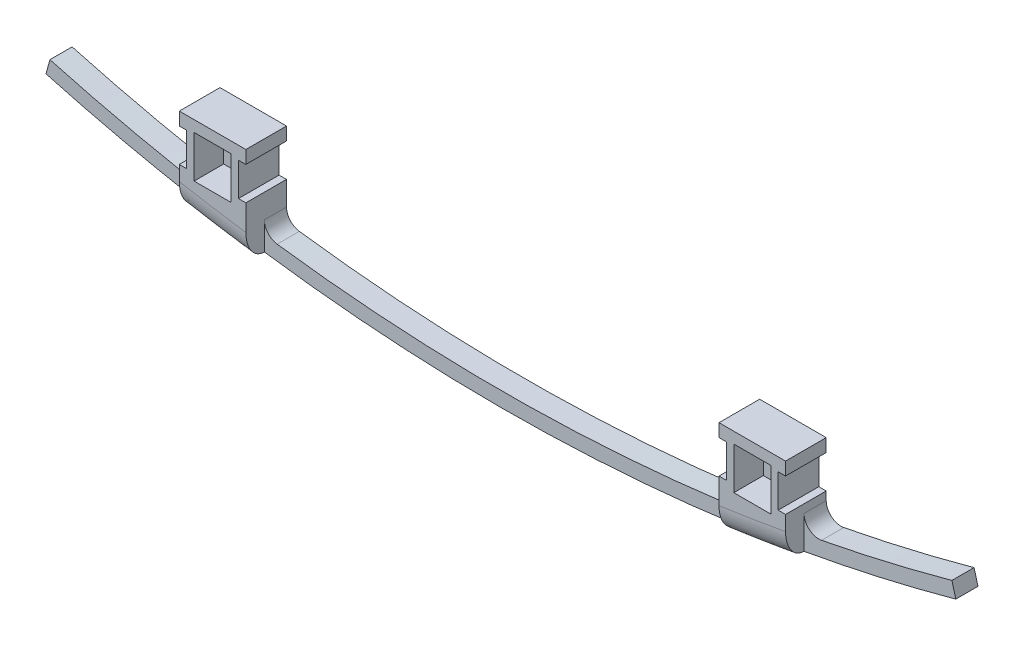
ISO-10303-21;
HEADER;
FILE_DESCRIPTION(('STEP AP214'),'2;1');
FILE_NAME('part.step','',(''),(''),'','','');
FILE_SCHEMA(('AUTOMOTIVE_DESIGN { 1 0 10303 214 1 1 1 1 }'));
ENDSEC;
DATA;
#1=APPLICATION_CONTEXT('core data for automotive mechanical design processes');
#2=APPLICATION_PROTOCOL_DEFINITION('international standard','automotive_design',2000,#1);
#3=PRODUCT_CONTEXT('',#1,'mechanical');
#4=PRODUCT('Part','Part','',(#3));
#5=PRODUCT_RELATED_PRODUCT_CATEGORY('part','',(#4));
#6=PRODUCT_DEFINITION_FORMATION('','',#4);
#7=PRODUCT_DEFINITION_CONTEXT('part definition',#1,'design');
#8=PRODUCT_DEFINITION('design','',#6,#7);
#9=PRODUCT_DEFINITION_SHAPE('','',#8);
#10=(LENGTH_UNIT() NAMED_UNIT(*) SI_UNIT(.MILLI.,.METRE.));
#11=(NAMED_UNIT(*) PLANE_ANGLE_UNIT() SI_UNIT($,.RADIAN.));
#12=(NAMED_UNIT(*) SI_UNIT($,.STERADIAN.) SOLID_ANGLE_UNIT());
#13=UNCERTAINTY_MEASURE_WITH_UNIT(LENGTH_MEASURE(1.E-05),#10,'distance_accuracy_value','');
#14=(GEOMETRIC_REPRESENTATION_CONTEXT(3) GLOBAL_UNCERTAINTY_ASSIGNED_CONTEXT((#13)) GLOBAL_UNIT_ASSIGNED_CONTEXT((#10,
#11,#12)) REPRESENTATION_CONTEXT('',''));
#15=CARTESIAN_POINT('',(0.,0.,0.));
#16=DIRECTION('',(0.,0.,1.));
#17=DIRECTION('',(1.,0.,0.));
#18=AXIS2_PLACEMENT_3D('',#15,#16,#17);
#19=CARTESIAN_POINT('',(79.5,1.52830621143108,0.));
#20=DIRECTION('',(1.,0.,0.));
#21=DIRECTION('',(0.,0.,-1.));
#22=AXIS2_PLACEMENT_3D('',#19,#20,#21);
#23=PLANE('',#22);
#24=DIRECTION('',(0.,0.,1.));
#25=VECTOR('',#24,1.);
#26=CARTESIAN_POINT('',(79.5,8.47830621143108,0.));
#27=LINE('',#26,#25);
#28=CARTESIAN_POINT('',(79.5,8.47830621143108,0.));
#29=VERTEX_POINT('',#28);
#30=CARTESIAN_POINT('',(79.5,8.47830621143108,5.5));
#31=VERTEX_POINT('',#30);
#32=EDGE_CURVE('E352',#29,#31,#27,.T.);
#33=ORIENTED_EDGE('',*,*,#32,.F.);
#34=DIRECTION('',(0.,1.,0.));
#35=VECTOR('',#34,1.);
#36=CARTESIAN_POINT('',(79.5,1.52830621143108,0.));
#37=LINE('',#36,#35);
#38=CARTESIAN_POINT('',(79.5,10.2283062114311,0.));
#39=VERTEX_POINT('',#38);
#40=EDGE_CURVE('E342',#29,#39,#37,.T.);
#41=ORIENTED_EDGE('',*,*,#40,.T.);
#42=DIRECTION('',(0.,0.,1.));
#43=VECTOR('',#42,1.);
#44=CARTESIAN_POINT('',(79.5,10.2283062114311,0.));
#45=LINE('',#44,#43);
#46=CARTESIAN_POINT('',(79.5,10.2283062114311,5.5));
#47=VERTEX_POINT('',#46);
#48=EDGE_CURVE('E764',#39,#47,#45,.T.);
#49=ORIENTED_EDGE('',*,*,#48,.T.);
#50=DIRECTION('',(0.,1.,0.));
#51=VECTOR('',#50,1.);
#52=CARTESIAN_POINT('',(79.5,1.52830621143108,5.5));
#53=LINE('',#52,#51);
#54=EDGE_CURVE('E467',#31,#47,#53,.T.);
#55=ORIENTED_EDGE('',*,*,#54,.F.);
#56=EDGE_LOOP('',(#33,#41,#49,#55));
#57=FACE_BOUND('',#56,.T.);
#58=ADVANCED_FACE('F40',(#57),#23,.T.);
#59=CARTESIAN_POINT('',(70.5,1.52830621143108,0.));
#60=DIRECTION('',(-1.,0.,0.));
#61=DIRECTION('',(0.,0.,1.));
#62=AXIS2_PLACEMENT_3D('',#59,#60,#61);
#63=PLANE('',#62);
#64=DIRECTION('',(0.,0.,1.));
#65=VECTOR('',#64,1.);
#66=CARTESIAN_POINT('',(70.5,8.47830621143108,0.));
#67=LINE('',#66,#65);
#68=CARTESIAN_POINT('',(70.5,8.47830621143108,0.));
#69=VERTEX_POINT('',#68);
#70=CARTESIAN_POINT('',(70.5,8.47830621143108,5.5));
#71=VERTEX_POINT('',#70);
#72=EDGE_CURVE('E376',#69,#71,#67,.T.);
#73=ORIENTED_EDGE('',*,*,#72,.T.);
#74=DIRECTION('',(0.,-1.,0.));
#75=VECTOR('',#74,1.);
#76=CARTESIAN_POINT('',(70.5,1.52830621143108,5.5));
#77=LINE('',#76,#75);
#78=CARTESIAN_POINT('',(70.5,10.2283062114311,5.5));
#79=VERTEX_POINT('',#78);
#80=EDGE_CURVE('E840',#79,#71,#77,.T.);
#81=ORIENTED_EDGE('',*,*,#80,.F.);
#82=DIRECTION('',(0.,0.,1.));
#83=VECTOR('',#82,1.);
#84=CARTESIAN_POINT('',(70.5,10.2283062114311,0.));
#85=LINE('',#84,#83);
#86=CARTESIAN_POINT('',(70.5,10.2283062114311,0.));
#87=VERTEX_POINT('',#86);
#88=EDGE_CURVE('E770',#87,#79,#85,.T.);
#89=ORIENTED_EDGE('',*,*,#88,.F.);
#90=DIRECTION('',(0.,-1.,0.));
#91=VECTOR('',#90,1.);
#92=CARTESIAN_POINT('',(70.5,1.52830621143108,0.));
#93=LINE('',#92,#91);
#94=EDGE_CURVE('E760',#87,#69,#93,.T.);
#95=ORIENTED_EDGE('',*,*,#94,.T.);
#96=EDGE_LOOP('',(#73,#81,#89,#95));
#97=FACE_BOUND('',#96,.T.);
#98=ADVANCED_FACE('F528',(#97),#63,.T.);
#99=CARTESIAN_POINT('',(6.49999999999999,1.52830621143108,0.));
#100=DIRECTION('',(1.,0.,0.));
#101=DIRECTION('',(0.,1.,0.));
#102=AXIS2_PLACEMENT_3D('',#99,#100,#101);
#103=PLANE('',#102);
#104=DIRECTION('',(0.,0.,1.));
#105=VECTOR('',#104,1.);
#106=CARTESIAN_POINT('',(6.49999999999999,8.47830621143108,0.));
#107=LINE('',#106,#105);
#108=CARTESIAN_POINT('',(6.49999999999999,8.47830621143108,0.));
#109=VERTEX_POINT('',#108);
#110=CARTESIAN_POINT('',(6.49999999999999,8.47830621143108,5.5));
#111=VERTEX_POINT('',#110);
#112=EDGE_CURVE('E402',#109,#111,#107,.T.);
#113=ORIENTED_EDGE('',*,*,#112,.F.);
#114=DIRECTION('',(0.,1.,0.));
#115=VECTOR('',#114,1.);
#116=CARTESIAN_POINT('',(6.49999999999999,1.52830621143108,0.));
#117=LINE('',#116,#115);
#118=CARTESIAN_POINT('',(6.49999999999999,10.2283062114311,0.));
#119=VERTEX_POINT('',#118);
#120=EDGE_CURVE('E572',#109,#119,#117,.T.);
#121=ORIENTED_EDGE('',*,*,#120,.T.);
#122=DIRECTION('',(0.,0.,1.));
#123=VECTOR('',#122,1.);
#124=CARTESIAN_POINT('',(6.49999999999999,10.2283062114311,0.));
#125=LINE('',#124,#123);
#126=CARTESIAN_POINT('',(6.49999999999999,10.2283062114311,5.5));
#127=VERTEX_POINT('',#126);
#128=EDGE_CURVE('E578',#119,#127,#125,.T.);
#129=ORIENTED_EDGE('',*,*,#128,.T.);
#130=DIRECTION('',(0.,1.,0.));
#131=VECTOR('',#130,1.);
#132=CARTESIAN_POINT('',(6.49999999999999,1.52830621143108,5.5));
#133=LINE('',#132,#131);
#134=EDGE_CURVE('E553',#111,#127,#133,.T.);
#135=ORIENTED_EDGE('',*,*,#134,.F.);
#136=EDGE_LOOP('',(#113,#121,#129,#135));
#137=FACE_BOUND('',#136,.T.);
#138=ADVANCED_FACE('F816',(#137),#103,.T.);
#139=CARTESIAN_POINT('',(-2.50000000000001,1.52830621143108,0.));
#140=DIRECTION('',(-1.,0.,0.));
#141=DIRECTION('',(0.,-1.,0.));
#142=AXIS2_PLACEMENT_3D('',#139,#140,#141);
#143=PLANE('',#142);
#144=DIRECTION('',(0.,0.,1.));
#145=VECTOR('',#144,1.);
#146=CARTESIAN_POINT('',(-2.50000000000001,8.47830621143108,0.));
#147=LINE('',#146,#145);
#148=CARTESIAN_POINT('',(-2.50000000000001,8.47830621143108,0.));
#149=VERTEX_POINT('',#148);
#150=CARTESIAN_POINT('',(-2.50000000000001,8.47830621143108,5.5));
#151=VERTEX_POINT('',#150);
#152=EDGE_CURVE('E429',#149,#151,#147,.T.);
#153=ORIENTED_EDGE('',*,*,#152,.T.);
#154=DIRECTION('',(0.,-1.,0.));
#155=VECTOR('',#154,1.);
#156=CARTESIAN_POINT('',(-2.50000000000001,1.52830621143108,5.5));
#157=LINE('',#156,#155);
#158=CARTESIAN_POINT('',(-2.50000000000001,10.2283062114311,5.5));
#159=VERTEX_POINT('',#158);
#160=EDGE_CURVE('E545',#159,#151,#157,.T.);
#161=ORIENTED_EDGE('',*,*,#160,.F.);
#162=DIRECTION('',(0.,0.,1.));
#163=VECTOR('',#162,1.);
#164=CARTESIAN_POINT('',(-2.50000000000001,10.2283062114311,0.));
#165=LINE('',#164,#163);
#166=CARTESIAN_POINT('',(-2.50000000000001,10.2283062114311,0.));
#167=VERTEX_POINT('',#166);
#168=EDGE_CURVE('E579',#167,#159,#165,.T.);
#169=ORIENTED_EDGE('',*,*,#168,.F.);
#170=DIRECTION('',(0.,-1.,0.));
#171=VECTOR('',#170,1.);
#172=CARTESIAN_POINT('',(-2.50000000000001,1.52830621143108,0.));
#173=LINE('',#172,#171);
#174=EDGE_CURVE('E569',#167,#149,#173,.T.);
#175=ORIENTED_EDGE('',*,*,#174,.T.);
#176=EDGE_LOOP('',(#153,#161,#169,#175));
#177=FACE_BOUND('',#176,.T.);
#178=ADVANCED_FACE('F943',(#177),#143,.T.);
#179=CARTESIAN_POINT('',(-0.500000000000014,3.02830621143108,0.));
#180=DIRECTION('',(-1.,0.,0.));
#181=DIRECTION('',(0.,0.,1.));
#182=AXIS2_PLACEMENT_3D('',#179,#180,#181);
#183=PLANE('',#182);
#184=DIRECTION('',(0.,1.,0.));
#185=VECTOR('',#184,1.);
#186=CARTESIAN_POINT('',(-0.500000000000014,8.72830621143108,1.5));
#187=LINE('',#186,#185);
#188=CARTESIAN_POINT('',(-0.500000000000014,3.02830621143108,1.5));
#189=VERTEX_POINT('',#188);
#190=CARTESIAN_POINT('',(-0.500000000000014,8.72830621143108,1.5));
#191=VERTEX_POINT('',#190);
#192=EDGE_CURVE('E442',#189,#191,#187,.T.);
#193=ORIENTED_EDGE('',*,*,#192,.T.);
#194=DIRECTION('',(0.,0.,1.));
#195=VECTOR('',#194,1.);
#196=CARTESIAN_POINT('',(-0.500000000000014,8.72830621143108,0.));
#197=LINE('',#196,#195);
#198=CARTESIAN_POINT('',(-0.500000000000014,8.72830621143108,5.5));
#199=VERTEX_POINT('',#198);
#200=EDGE_CURVE('E561',#191,#199,#197,.T.);
#201=ORIENTED_EDGE('',*,*,#200,.T.);
#202=DIRECTION('',(0.,-1.,0.));
#203=VECTOR('',#202,1.);
#204=CARTESIAN_POINT('',(-0.500000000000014,3.02830621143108,5.5));
#205=LINE('',#204,#203);
#206=CARTESIAN_POINT('',(-0.500000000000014,3.02830621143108,5.5));
#207=VERTEX_POINT('',#206);
#208=EDGE_CURVE('E775',#199,#207,#205,.T.);
#209=ORIENTED_EDGE('',*,*,#208,.T.);
#210=DIRECTION('',(0.,0.,1.));
#211=VECTOR('',#210,1.);
#212=CARTESIAN_POINT('',(-0.500000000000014,3.02830621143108,0.));
#213=LINE('',#212,#211);
#214=EDGE_CURVE('E560',#189,#207,#213,.T.);
#215=ORIENTED_EDGE('',*,*,#214,.F.);
#216=EDGE_LOOP('',(#193,#201,#209,#215));
#217=FACE_BOUND('',#216,.T.);
#218=ADVANCED_FACE('F796',(#217),#183,.F.);
#219=CARTESIAN_POINT('',(-0.500000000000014,8.72830621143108,0.));
#220=DIRECTION('',(0.,1.,0.));
#221=DIRECTION('',(0.,0.,1.));
#222=AXIS2_PLACEMENT_3D('',#219,#220,#221);
#223=PLANE('',#222);
#224=DIRECTION('',(1.,0.,0.));
#225=VECTOR('',#224,1.);
#226=CARTESIAN_POINT('',(4.49999999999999,8.72830621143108,1.5));
#227=LINE('',#226,#225);
#228=CARTESIAN_POINT('',(4.49999999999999,8.72830621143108,1.5));
#229=VERTEX_POINT('',#228);
#230=EDGE_CURVE('E444',#191,#229,#227,.T.);
#231=ORIENTED_EDGE('',*,*,#230,.T.);
#232=DIRECTION('',(0.,0.,1.));
#233=VECTOR('',#232,1.);
#234=CARTESIAN_POINT('',(4.49999999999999,8.72830621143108,0.));
#235=LINE('',#234,#233);
#236=CARTESIAN_POINT('',(4.49999999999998,8.72830621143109,5.5));
#237=VERTEX_POINT('',#236);
#238=EDGE_CURVE('E564',#229,#237,#235,.T.);
#239=ORIENTED_EDGE('',*,*,#238,.T.);
#240=DIRECTION('',(-1.,0.,0.));
#241=VECTOR('',#240,1.);
#242=CARTESIAN_POINT('',(-0.500000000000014,8.72830621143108,5.5));
#243=LINE('',#242,#241);
#244=EDGE_CURVE('E546',#237,#199,#243,.T.);
#245=ORIENTED_EDGE('',*,*,#244,.T.);
#246=ORIENTED_EDGE('',*,*,#200,.F.);
#247=EDGE_LOOP('',(#231,#239,#245,#246));
#248=FACE_BOUND('',#247,.T.);
#249=ADVANCED_FACE('F790',(#248),#223,.F.);
#250=CARTESIAN_POINT('',(4.49999999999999,3.02830621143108,0.));
#251=DIRECTION('',(1.,0.,0.));
#252=DIRECTION('',(0.,0.,-1.));
#253=AXIS2_PLACEMENT_3D('',#250,#251,#252);
#254=PLANE('',#253);
#255=DIRECTION('',(0.,-1.,0.));
#256=VECTOR('',#255,1.);
#257=CARTESIAN_POINT('',(4.49999999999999,8.72830621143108,1.5));
#258=LINE('',#257,#256);
#259=CARTESIAN_POINT('',(4.49999999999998,3.02830621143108,1.5));
#260=VERTEX_POINT('',#259);
#261=EDGE_CURVE('E432',#229,#260,#258,.T.);
#262=ORIENTED_EDGE('',*,*,#261,.T.);
#263=DIRECTION('',(0.,0.,1.));
#264=VECTOR('',#263,1.);
#265=CARTESIAN_POINT('',(4.49999999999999,3.02830621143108,0.));
#266=LINE('',#265,#264);
#267=CARTESIAN_POINT('',(4.49999999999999,3.02830621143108,5.5));
#268=VERTEX_POINT('',#267);
#269=EDGE_CURVE('E566',#260,#268,#266,.T.);
#270=ORIENTED_EDGE('',*,*,#269,.T.);
#271=DIRECTION('',(0.,1.,0.));
#272=VECTOR('',#271,1.);
#273=CARTESIAN_POINT('',(4.49999999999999,3.02830621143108,5.5));
#274=LINE('',#273,#272);
#275=EDGE_CURVE('E780',#268,#237,#274,.T.);
#276=ORIENTED_EDGE('',*,*,#275,.T.);
#277=ORIENTED_EDGE('',*,*,#238,.F.);
#278=EDGE_LOOP('',(#262,#270,#276,#277));
#279=FACE_BOUND('',#278,.T.);
#280=ADVANCED_FACE('F802',(#279),#254,.F.);
#281=CARTESIAN_POINT('',(-0.500000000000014,3.02830621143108,0.));
#282=DIRECTION('',(0.,-1.,0.));
#283=DIRECTION('',(0.,0.,-1.));
#284=AXIS2_PLACEMENT_3D('',#281,#282,#283);
#285=PLANE('',#284);
#286=DIRECTION('',(-1.,0.,0.));
#287=VECTOR('',#286,1.);
#288=CARTESIAN_POINT('',(4.49999999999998,3.02830621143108,1.5));
#289=LINE('',#288,#287);
#290=EDGE_CURVE('E440',#260,#189,#289,.T.);
#291=ORIENTED_EDGE('',*,*,#290,.T.);
#292=ORIENTED_EDGE('',*,*,#214,.T.);
#293=DIRECTION('',(1.,0.,0.));
#294=VECTOR('',#293,1.);
#295=CARTESIAN_POINT('',(-0.500000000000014,3.02830621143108,5.5));
#296=LINE('',#295,#294);
#297=EDGE_CURVE('E778',#207,#268,#296,.T.);
#298=ORIENTED_EDGE('',*,*,#297,.T.);
#299=ORIENTED_EDGE('',*,*,#269,.F.);
#300=EDGE_LOOP('',(#291,#292,#298,#299));
#301=FACE_BOUND('',#300,.T.);
#302=ADVANCED_FACE('F519',(#301),#285,.F.);
#303=CARTESIAN_POINT('',(77.5,3.02830621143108,0.));
#304=DIRECTION('',(0.,-1.,0.));
#305=DIRECTION('',(0.,0.,-1.));
#306=AXIS2_PLACEMENT_3D('',#303,#304,#305);
#307=PLANE('',#306);
#308=DIRECTION('',(-1.,0.,0.));
#309=VECTOR('',#308,1.);
#310=CARTESIAN_POINT('',(77.5,3.02830621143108,1.5));
#311=LINE('',#310,#309);
#312=CARTESIAN_POINT('',(77.5,3.02830621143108,1.5));
#313=VERTEX_POINT('',#312);
#314=CARTESIAN_POINT('',(72.5,3.02830621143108,1.5));
#315=VERTEX_POINT('',#314);
#316=EDGE_CURVE('E448',#313,#315,#311,.T.);
#317=ORIENTED_EDGE('',*,*,#316,.T.);
#318=DIRECTION('',(0.,0.,1.));
#319=VECTOR('',#318,1.);
#320=CARTESIAN_POINT('',(72.5,3.02830621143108,0.));
#321=LINE('',#320,#319);
#322=CARTESIAN_POINT('',(72.5,3.02830621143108,5.5));
#323=VERTEX_POINT('',#322);
#324=EDGE_CURVE('E835',#315,#323,#321,.T.);
#325=ORIENTED_EDGE('',*,*,#324,.T.);
#326=DIRECTION('',(1.,0.,0.));
#327=VECTOR('',#326,1.);
#328=CARTESIAN_POINT('',(77.5,3.02830621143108,5.5));
#329=LINE('',#328,#327);
#330=CARTESIAN_POINT('',(77.5,3.02830621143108,5.5));
#331=VERTEX_POINT('',#330);
#332=EDGE_CURVE('E455',#323,#331,#329,.T.);
#333=ORIENTED_EDGE('',*,*,#332,.T.);
#334=DIRECTION('',(0.,0.,1.));
#335=VECTOR('',#334,1.);
#336=CARTESIAN_POINT('',(77.5,3.02830621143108,0.));
#337=LINE('',#336,#335);
#338=EDGE_CURVE('E837',#313,#331,#337,.T.);
#339=ORIENTED_EDGE('',*,*,#338,.F.);
#340=EDGE_LOOP('',(#317,#325,#333,#339));
#341=FACE_BOUND('',#340,.T.);
#342=ADVANCED_FACE('F507',(#341),#307,.F.);
#343=CARTESIAN_POINT('',(72.5,3.02830621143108,0.));
#344=DIRECTION('',(-1.,0.,0.));
#345=DIRECTION('',(0.,0.,1.));
#346=AXIS2_PLACEMENT_3D('',#343,#344,#345);
#347=PLANE('',#346);
#348=DIRECTION('',(0.,1.,0.));
#349=VECTOR('',#348,1.);
#350=CARTESIAN_POINT('',(72.5,8.72830621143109,1.5));
#351=LINE('',#350,#349);
#352=CARTESIAN_POINT('',(72.5,8.72830621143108,1.5));
#353=VERTEX_POINT('',#352);
#354=EDGE_CURVE('E450',#315,#353,#351,.T.);
#355=ORIENTED_EDGE('',*,*,#354,.T.);
#356=DIRECTION('',(0.,0.,1.));
#357=VECTOR('',#356,1.);
#358=CARTESIAN_POINT('',(72.5,8.72830621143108,0.));
#359=LINE('',#358,#357);
#360=CARTESIAN_POINT('',(72.5,8.72830621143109,5.5));
#361=VERTEX_POINT('',#360);
#362=EDGE_CURVE('E842',#353,#361,#359,.T.);
#363=ORIENTED_EDGE('',*,*,#362,.T.);
#364=DIRECTION('',(0.,-1.,0.));
#365=VECTOR('',#364,1.);
#366=CARTESIAN_POINT('',(72.5,3.02830621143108,5.5));
#367=LINE('',#366,#365);
#368=EDGE_CURVE('E464',#361,#323,#367,.T.);
#369=ORIENTED_EDGE('',*,*,#368,.T.);
#370=ORIENTED_EDGE('',*,*,#324,.F.);
#371=EDGE_LOOP('',(#355,#363,#369,#370));
#372=FACE_BOUND('',#371,.T.);
#373=ADVANCED_FACE('F503',(#372),#347,.F.);
#374=CARTESIAN_POINT('',(77.5,8.72830621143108,0.));
#375=DIRECTION('',(0.,1.,0.));
#376=DIRECTION('',(0.,0.,1.));
#377=AXIS2_PLACEMENT_3D('',#374,#375,#376);
#378=PLANE('',#377);
#379=DIRECTION('',(1.,0.,0.));
#380=VECTOR('',#379,1.);
#381=CARTESIAN_POINT('',(77.5,8.72830621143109,1.5));
#382=LINE('',#381,#380);
#383=CARTESIAN_POINT('',(77.5,8.72830621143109,1.5));
#384=VERTEX_POINT('',#383);
#385=EDGE_CURVE('E452',#353,#384,#382,.T.);
#386=ORIENTED_EDGE('',*,*,#385,.T.);
#387=DIRECTION('',(0.,0.,1.));
#388=VECTOR('',#387,1.);
#389=CARTESIAN_POINT('',(77.5,8.72830621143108,0.));
#390=LINE('',#389,#388);
#391=CARTESIAN_POINT('',(77.5,8.72830621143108,5.5));
#392=VERTEX_POINT('',#391);
#393=EDGE_CURVE('E839',#384,#392,#390,.T.);
#394=ORIENTED_EDGE('',*,*,#393,.T.);
#395=DIRECTION('',(-1.,0.,0.));
#396=VECTOR('',#395,1.);
#397=CARTESIAN_POINT('',(77.5,8.72830621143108,5.5));
#398=LINE('',#397,#396);
#399=EDGE_CURVE('E461',#392,#361,#398,.T.);
#400=ORIENTED_EDGE('',*,*,#399,.T.);
#401=ORIENTED_EDGE('',*,*,#362,.F.);
#402=EDGE_LOOP('',(#386,#394,#400,#401));
#403=FACE_BOUND('',#402,.T.);
#404=ADVANCED_FACE('F506',(#403),#378,.F.);
#405=CARTESIAN_POINT('',(77.5,3.02830621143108,0.));
#406=DIRECTION('',(1.,0.,0.));
#407=DIRECTION('',(0.,0.,-1.));
#408=AXIS2_PLACEMENT_3D('',#405,#406,#407);
#409=PLANE('',#408);
#410=DIRECTION('',(0.,-1.,0.));
#411=VECTOR('',#410,1.);
#412=CARTESIAN_POINT('',(77.5,8.72830621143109,1.5));
#413=LINE('',#412,#411);
#414=EDGE_CURVE('E446',#384,#313,#413,.T.);
#415=ORIENTED_EDGE('',*,*,#414,.T.);
#416=ORIENTED_EDGE('',*,*,#338,.T.);
#417=DIRECTION('',(0.,1.,0.));
#418=VECTOR('',#417,1.);
#419=CARTESIAN_POINT('',(77.5,3.02830621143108,5.5));
#420=LINE('',#419,#418);
#421=EDGE_CURVE('E458',#331,#392,#420,.T.);
#422=ORIENTED_EDGE('',*,*,#421,.T.);
#423=ORIENTED_EDGE('',*,*,#393,.F.);
#424=EDGE_LOOP('',(#415,#416,#422,#423));
#425=FACE_BOUND('',#424,.T.);
#426=ADVANCED_FACE('F511',(#425),#409,.F.);
#427=CARTESIAN_POINT('',(38.5,226.375,3.));
#428=DIRECTION('',(0.,0.,-1.));
#429=DIRECTION('',(-1.,0.,0.));
#430=AXIS2_PLACEMENT_3D('',#427,#428,#429);
#431=CYLINDRICAL_SURFACE('',#430,229.625544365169);
#432=CARTESIAN_POINT('',(38.5,226.375,3.));
#433=DIRECTION('',(0.,0.,-1.));
#434=DIRECTION('',(1.,0.,0.));
#435=AXIS2_PLACEMENT_3D('',#432,#433,#434);
#436=CIRCLE('',#435,229.625544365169);
#437=CARTESIAN_POINT('',(68.7635908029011,-1.24750700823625,3.));
#438=VERTEX_POINT('',#437);
#439=CARTESIAN_POINT('',(8.23640919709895,-1.24750700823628,3.));
#440=VERTEX_POINT('',#439);
#441=EDGE_CURVE('E588',#438,#440,#436,.T.);
#442=ORIENTED_EDGE('',*,*,#441,.F.);
#443=DIRECTION('',(0.,0.,-1.));
#444=VECTOR('',#443,1.);
#445=CARTESIAN_POINT('',(68.7635908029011,-1.24750700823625,3.));
#446=LINE('',#445,#444);
#447=CARTESIAN_POINT('',(68.7635908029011,-1.24750700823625,0.));
#448=VERTEX_POINT('',#447);
#449=EDGE_CURVE('E718',#438,#448,#446,.T.);
#450=ORIENTED_EDGE('',*,*,#449,.T.);
#451=CARTESIAN_POINT('',(38.5,226.375,0.));
#452=DIRECTION('',(0.,0.,-1.));
#453=DIRECTION('',(1.,0.,0.));
#454=AXIS2_PLACEMENT_3D('',#451,#452,#453);
#455=CIRCLE('',#454,229.625544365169);
#456=CARTESIAN_POINT('',(8.23640919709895,-1.24750700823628,0.));
#457=VERTEX_POINT('',#456);
#458=EDGE_CURVE('E650',#448,#457,#455,.T.);
#459=ORIENTED_EDGE('',*,*,#458,.T.);
#460=DIRECTION('',(0.,0.,-1.));
#461=VECTOR('',#460,1.);
#462=CARTESIAN_POINT('',(8.23640919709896,-1.24750700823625,3.));
#463=LINE('',#462,#461);
#464=EDGE_CURVE('E709',#457,#440,#463,.F.);
#465=ORIENTED_EDGE('',*,*,#464,.T.);
#466=EDGE_LOOP('',(#442,#450,#459,#465));
#467=FACE_BOUND('',#466,.T.);
#468=ADVANCED_FACE('F515',(#467),#431,.F.);
#469=CARTESIAN_POINT('',(38.5,226.375,3.));
#470=DIRECTION('',(0.,0.,1.));
#471=DIRECTION('',(1.,0.,0.));
#472=AXIS2_PLACEMENT_3D('',#469,#470,#471);
#473=PLANE('',#472);
#474=DIRECTION('',(0.,-1.,0.));
#475=VECTOR('',#474,1.);
#476=CARTESIAN_POINT('',(70.5,226.375,3.));
#477=LINE('',#476,#475);
#478=CARTESIAN_POINT('',(70.5,0.735046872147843,3.));
#479=VERTEX_POINT('',#478);
#480=CARTESIAN_POINT('',(70.5,-3.02943065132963,3.));
#481=VERTEX_POINT('',#480);
#482=EDGE_CURVE('E625',#479,#481,#477,.T.);
#483=ORIENTED_EDGE('',*,*,#482,.F.);
#484=CARTESIAN_POINT('',(68.5,0.735046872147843,3.));
#485=DIRECTION('',(0.,0.,1.));
#486=DIRECTION('',(1.,0.,0.));
#487=AXIS2_PLACEMENT_3D('',#484,#485,#486);
#488=CIRCLE('',#487,2.);
#489=EDGE_CURVE('E737',#479,#438,#488,.F.);
#490=ORIENTED_EDGE('',*,*,#489,.T.);
#491=ORIENTED_EDGE('',*,*,#441,.T.);
#492=CARTESIAN_POINT('',(8.49999999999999,0.735046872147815,3.));
#493=DIRECTION('',(0.,0.,1.));
#494=DIRECTION('',(1.,0.,0.));
#495=AXIS2_PLACEMENT_3D('',#492,#493,#494);
#496=CIRCLE('',#495,2.);
#497=CARTESIAN_POINT('',(6.49999999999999,0.735046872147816,3.));
#498=VERTEX_POINT('',#497);
#499=EDGE_CURVE('E48',#440,#498,#496,.F.);
#500=ORIENTED_EDGE('',*,*,#499,.T.);
#501=DIRECTION('',(0.,1.,0.));
#502=VECTOR('',#501,1.);
#503=CARTESIAN_POINT('',(6.50000000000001,226.375,3.));
#504=LINE('',#503,#502);
#505=CARTESIAN_POINT('',(6.49999999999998,-3.02943065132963,3.));
#506=VERTEX_POINT('',#505);
#507=EDGE_CURVE('E55',#506,#498,#504,.T.);
#508=ORIENTED_EDGE('',*,*,#507,.F.);
#509=CARTESIAN_POINT('',(38.5,226.375,3.));
#510=DIRECTION('',(0.,0.,1.));
#511=DIRECTION('',(1.,0.,0.));
#512=AXIS2_PLACEMENT_3D('',#509,#510,#511);
#513=CIRCLE('',#512,231.625544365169);
#514=EDGE_CURVE('E603',#506,#481,#513,.T.);
#515=ORIENTED_EDGE('',*,*,#514,.T.);
#516=EDGE_LOOP('',(#483,#490,#491,#500,#508,#515));
#517=FACE_BOUND('',#516,.T.);
#518=ADVANCED_FACE('F744',(#517),#473,.T.);
#519=CARTESIAN_POINT('',(99.5,5.,0.));
#520=VERTEX_POINT('',#519);
#521=CARTESIAN_POINT('',(81.8778134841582,0.88385622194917,0.));
#522=VERTEX_POINT('',#521);
#523=EDGE_CURVE('E651',#520,#522,#455,.T.);
#524=ORIENTED_EDGE('',*,*,#523,.T.);
#525=DIRECTION('',(0.,0.,-1.));
#526=VECTOR('',#525,1.);
#527=CARTESIAN_POINT('',(81.8778134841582,0.88385622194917,3.));
#528=LINE('',#527,#526);
#529=CARTESIAN_POINT('',(81.8778134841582,0.88385622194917,3.));
#530=VERTEX_POINT('',#529);
#531=EDGE_CURVE('E701',#522,#530,#528,.F.);
#532=ORIENTED_EDGE('',*,*,#531,.T.);
#533=CARTESIAN_POINT('',(99.5,5.,3.));
#534=VERTEX_POINT('',#533);
#535=EDGE_CURVE('E584',#534,#530,#436,.T.);
#536=ORIENTED_EDGE('',*,*,#535,.F.);
#537=DIRECTION('',(0.,0.,-1.));
#538=VECTOR('',#537,1.);
#539=CARTESIAN_POINT('',(99.5,5.,3.));
#540=LINE('',#539,#538);
#541=EDGE_CURVE('E675',#534,#520,#540,.T.);
#542=ORIENTED_EDGE('',*,*,#541,.T.);
#543=EDGE_LOOP('',(#524,#532,#536,#542));
#544=FACE_BOUND('',#543,.T.);
#545=ADVANCED_FACE('F993',(#544),#431,.F.);
#546=DIRECTION('',(0.,1.,0.));
#547=VECTOR('',#546,1.);
#548=CARTESIAN_POINT('',(79.5,226.375,3.));
#549=LINE('',#548,#547);
#550=CARTESIAN_POINT('',(79.5,-1.59296442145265,3.));
#551=VERTEX_POINT('',#550);
#552=CARTESIAN_POINT('',(79.5,2.84784628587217,3.));
#553=VERTEX_POINT('',#552);
#554=EDGE_CURVE('E772',#551,#553,#549,.T.);
#555=ORIENTED_EDGE('',*,*,#554,.F.);
#556=CARTESIAN_POINT('',(100.031299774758,3.07186085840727,3.));
#557=VERTEX_POINT('',#556);
#558=EDGE_CURVE('E591',#551,#557,#513,.T.);
#559=ORIENTED_EDGE('',*,*,#558,.T.);
#560=DIRECTION('',(-0.265649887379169,0.964069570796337,0.));
#561=VECTOR('',#560,1.);
#562=CARTESIAN_POINT('',(100.031299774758,3.07186085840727,3.));
#563=LINE('',#562,#561);
#564=EDGE_CURVE('E594',#557,#534,#563,.T.);
#565=ORIENTED_EDGE('',*,*,#564,.T.);
#566=ORIENTED_EDGE('',*,*,#535,.T.);
#567=CARTESIAN_POINT('',(81.5,2.84784628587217,3.));
#568=DIRECTION('',(0.,0.,1.));
#569=DIRECTION('',(1.,0.,0.));
#570=AXIS2_PLACEMENT_3D('',#567,#568,#569);
#571=CIRCLE('',#570,2.);
#572=EDGE_CURVE('E730',#530,#553,#571,.F.);
#573=ORIENTED_EDGE('',*,*,#572,.T.);
#574=EDGE_LOOP('',(#555,#559,#565,#566,#573));
#575=FACE_BOUND('',#574,.T.);
#576=ADVANCED_FACE('F829',(#575),#473,.T.);
#577=CARTESIAN_POINT('',(-4.87781348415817,0.88385622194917,3.));
#578=VERTEX_POINT('',#577);
#579=CARTESIAN_POINT('',(-22.5,5.,3.));
#580=VERTEX_POINT('',#579);
#581=EDGE_CURVE('E589',#578,#580,#436,.T.);
#582=ORIENTED_EDGE('',*,*,#581,.F.);
#583=DIRECTION('',(0.,0.,-1.));
#584=VECTOR('',#583,1.);
#585=CARTESIAN_POINT('',(-4.87781348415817,0.88385622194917,3.));
#586=LINE('',#585,#584);
#587=CARTESIAN_POINT('',(-4.87781348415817,0.88385622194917,0.));
#588=VERTEX_POINT('',#587);
#589=EDGE_CURVE('E724',#578,#588,#586,.T.);
#590=ORIENTED_EDGE('',*,*,#589,.T.);
#591=CARTESIAN_POINT('',(-22.5,5.,0.));
#592=VERTEX_POINT('',#591);
#593=EDGE_CURVE('E649',#588,#592,#455,.T.);
#594=ORIENTED_EDGE('',*,*,#593,.T.);
#595=DIRECTION('',(0.,0.,-1.));
#596=VECTOR('',#595,1.);
#597=CARTESIAN_POINT('',(-22.5,5.,3.));
#598=LINE('',#597,#596);
#599=EDGE_CURVE('E681',#580,#592,#598,.T.);
#600=ORIENTED_EDGE('',*,*,#599,.F.);
#601=EDGE_LOOP('',(#582,#590,#594,#600));
#602=FACE_BOUND('',#601,.T.);
#603=ADVANCED_FACE('F994',(#602),#431,.F.);
#604=CARTESIAN_POINT('',(-23.0312997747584,3.0718608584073,3.));
#605=DIRECTION('',(0.964069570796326,-0.265649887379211,0.));
#606=DIRECTION('',(0.265649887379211,0.964069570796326,0.));
#607=AXIS2_PLACEMENT_3D('',#604,#605,#606);
#608=PLANE('',#607);
#609=DIRECTION('',(-0.265649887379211,-0.964069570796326,0.));
#610=VECTOR('',#609,1.);
#611=CARTESIAN_POINT('',(-23.0312997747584,3.0718608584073,0.));
#612=LINE('',#611,#610);
#613=CARTESIAN_POINT('',(-23.0312997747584,3.0718608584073,0.));
#614=VERTEX_POINT('',#613);
#615=EDGE_CURVE('E660',#592,#614,#612,.T.);
#616=ORIENTED_EDGE('',*,*,#615,.T.);
#617=DIRECTION('',(0.,0.,-1.));
#618=VECTOR('',#617,1.);
#619=CARTESIAN_POINT('',(-23.0312997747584,3.0718608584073,3.));
#620=LINE('',#619,#618);
#621=CARTESIAN_POINT('',(-23.0312997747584,3.0718608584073,3.));
#622=VERTEX_POINT('',#621);
#623=EDGE_CURVE('E680',#622,#614,#620,.T.);
#624=ORIENTED_EDGE('',*,*,#623,.F.);
#625=DIRECTION('',(-0.265649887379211,-0.964069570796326,0.));
#626=VECTOR('',#625,1.);
#627=CARTESIAN_POINT('',(-23.0312997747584,3.0718608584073,3.));
#628=LINE('',#627,#626);
#629=EDGE_CURVE('E587',#580,#622,#628,.T.);
#630=ORIENTED_EDGE('',*,*,#629,.F.);
#631=ORIENTED_EDGE('',*,*,#599,.T.);
#632=EDGE_LOOP('',(#616,#624,#630,#631));
#633=FACE_BOUND('',#632,.T.);
#634=ADVANCED_FACE('F637',(#633),#608,.F.);
#635=CARTESIAN_POINT('',(38.5,226.375,3.));
#636=DIRECTION('',(0.,0.,-1.));
#637=DIRECTION('',(-1.,0.,0.));
#638=AXIS2_PLACEMENT_3D('',#635,#636,#637);
#639=CYLINDRICAL_SURFACE('',#638,231.625544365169);
#640=ORIENTED_EDGE('',*,*,#558,.F.);
#641=CARTESIAN_POINT('',(70.0169163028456,-3.09629839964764,3.));
#642=CARTESIAN_POINT('',(73.5600455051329,-2.6096645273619,3.));
#643=CARTESIAN_POINT('',(77.091900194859,-2.04095526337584,3.));
#644=CARTESIAN_POINT('',(80.608695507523,-1.39078005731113,3.));
#645=(BOUNDED_CURVE() B_SPLINE_CURVE(3,(#641,#642,#643,#644),.UNSPECIFIED.,.F.,
.F.) B_SPLINE_CURVE_WITH_KNOTS((4,4),(4.52957597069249,4.57589717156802),
.UNSPECIFIED.) CURVE() GEOMETRIC_REPRESENTATION_ITEM() RATIONAL_B_SPLINE_CURVE((1.,1.,1.,1.)) REPRESENTATION_ITEM(''));
#646=EDGE_CURVE('E620',#551,#481,#645,.F.);
#647=ORIENTED_EDGE('',*,*,#646,.T.);
#648=ORIENTED_EDGE('',*,*,#514,.F.);
#649=CARTESIAN_POINT('',(-3.60869550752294,-1.39078005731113,3.));
#650=CARTESIAN_POINT('',(-0.0919001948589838,-2.04095526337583,3.));
#651=CARTESIAN_POINT('',(3.43995449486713,-2.60966452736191,3.));
#652=CARTESIAN_POINT('',(6.98308369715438,-3.09629839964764,3.));
#653=(BOUNDED_CURVE() B_SPLINE_CURVE(3,(#649,#650,#651,#652),.UNSPECIFIED.,.F.,
.F.) B_SPLINE_CURVE_WITH_KNOTS((4,4),(4.52957597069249,4.57589717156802),
.UNSPECIFIED.) CURVE() GEOMETRIC_REPRESENTATION_ITEM() RATIONAL_B_SPLINE_CURVE((1.,1.,1.,1.)) REPRESENTATION_ITEM(''));
#654=CARTESIAN_POINT('',(-2.50000000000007,-1.59296442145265,3.));
#655=VERTEX_POINT('',#654);
#656=EDGE_CURVE('E684',#506,#655,#653,.F.);
#657=ORIENTED_EDGE('',*,*,#656,.T.);
#658=EDGE_CURVE('E606',#622,#655,#513,.T.);
#659=ORIENTED_EDGE('',*,*,#658,.F.);
#660=ORIENTED_EDGE('',*,*,#623,.T.);
#661=CARTESIAN_POINT('',(38.5,226.375,0.));
#662=DIRECTION('',(0.,0.,1.));
#663=DIRECTION('',(1.,0.,0.));
#664=AXIS2_PLACEMENT_3D('',#661,#662,#663);
#665=CIRCLE('',#664,231.625544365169);
#666=CARTESIAN_POINT('',(100.031299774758,3.07186085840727,0.));
#667=VERTEX_POINT('',#666);
#668=EDGE_CURVE('E666',#614,#667,#665,.T.);
#669=ORIENTED_EDGE('',*,*,#668,.T.);
#670=DIRECTION('',(0.,0.,-1.));
#671=VECTOR('',#670,1.);
#672=CARTESIAN_POINT('',(100.031299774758,3.07186085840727,3.));
#673=LINE('',#672,#671);
#674=EDGE_CURVE('E677',#557,#667,#673,.T.);
#675=ORIENTED_EDGE('',*,*,#674,.F.);
#676=EDGE_LOOP('',(#640,#647,#648,#657,#659,#660,#669,#675));
#677=FACE_BOUND('',#676,.T.);
#678=ADVANCED_FACE('F626',(#677),#639,.T.);
#679=CARTESIAN_POINT('',(100.031299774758,3.07186085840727,3.));
#680=DIRECTION('',(-0.964069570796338,-0.265649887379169,0.));
#681=DIRECTION('',(0.265649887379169,-0.964069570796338,0.));
#682=AXIS2_PLACEMENT_3D('',#679,#680,#681);
#683=PLANE('',#682);
#684=DIRECTION('',(-0.265649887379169,0.964069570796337,0.));
#685=VECTOR('',#684,1.);
#686=CARTESIAN_POINT('',(100.031299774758,3.07186085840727,0.));
#687=LINE('',#686,#685);
#688=EDGE_CURVE('E671',#667,#520,#687,.T.);
#689=ORIENTED_EDGE('',*,*,#688,.T.);
#690=ORIENTED_EDGE('',*,*,#541,.F.);
#691=ORIENTED_EDGE('',*,*,#564,.F.);
#692=ORIENTED_EDGE('',*,*,#674,.T.);
#693=EDGE_LOOP('',(#689,#690,#691,#692));
#694=FACE_BOUND('',#693,.T.);
#695=ADVANCED_FACE('F636',(#694),#683,.F.);
#696=DIRECTION('',(0.,-1.,0.));
#697=VECTOR('',#696,1.);
#698=CARTESIAN_POINT('',(-2.49999999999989,226.375,3.));
#699=LINE('',#698,#697);
#700=CARTESIAN_POINT('',(-2.50000000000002,2.84784628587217,3.));
#701=VERTEX_POINT('',#700);
#702=EDGE_CURVE('E581',#701,#655,#699,.T.);
#703=ORIENTED_EDGE('',*,*,#702,.F.);
#704=CARTESIAN_POINT('',(-4.50000000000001,2.84784628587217,3.));
#705=DIRECTION('',(0.,0.,1.));
#706=DIRECTION('',(1.,0.,0.));
#707=AXIS2_PLACEMENT_3D('',#704,#705,#706);
#708=CIRCLE('',#707,2.);
#709=EDGE_CURVE('E741',#701,#578,#708,.F.);
#710=ORIENTED_EDGE('',*,*,#709,.T.);
#711=ORIENTED_EDGE('',*,*,#581,.T.);
#712=ORIENTED_EDGE('',*,*,#629,.T.);
#713=ORIENTED_EDGE('',*,*,#658,.T.);
#714=EDGE_LOOP('',(#703,#710,#711,#712,#713));
#715=FACE_BOUND('',#714,.T.);
#716=ADVANCED_FACE('F1002',(#715),#473,.T.);
#717=CARTESIAN_POINT('',(38.5,226.375,0.));
#718=DIRECTION('',(0.,0.,1.));
#719=DIRECTION('',(1.,0.,0.));
#720=AXIS2_PLACEMENT_3D('',#717,#718,#719);
#721=PLANE('',#720);
#722=ORIENTED_EDGE('',*,*,#40,.F.);
#723=DIRECTION('',(-1.,0.,0.));
#724=VECTOR('',#723,1.);
#725=CARTESIAN_POINT('',(79.5,8.47830621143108,0.));
#726=LINE('',#725,#724);
#727=CARTESIAN_POINT('',(78.5,8.47830621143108,0.));
#728=VERTEX_POINT('',#727);
#729=EDGE_CURVE('E322',#29,#728,#726,.T.);
#730=ORIENTED_EDGE('',*,*,#729,.T.);
#731=DIRECTION('',(0.,-1.,0.));
#732=VECTOR('',#731,1.);
#733=CARTESIAN_POINT('',(78.5,8.47830621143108,0.));
#734=LINE('',#733,#732);
#735=CARTESIAN_POINT('',(78.5,3.97830621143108,0.));
#736=VERTEX_POINT('',#735);
#737=EDGE_CURVE('E333',#728,#736,#734,.T.);
#738=ORIENTED_EDGE('',*,*,#737,.T.);
#739=DIRECTION('',(1.,0.,0.));
#740=VECTOR('',#739,1.);
#741=CARTESIAN_POINT('',(79.5,3.97830621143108,0.));
#742=LINE('',#741,#740);
#743=CARTESIAN_POINT('',(79.5,3.97830621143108,0.));
#744=VERTEX_POINT('',#743);
#745=EDGE_CURVE('E330',#736,#744,#742,.T.);
#746=ORIENTED_EDGE('',*,*,#745,.T.);
#747=CARTESIAN_POINT('',(79.5,2.84784628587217,0.));
#748=VERTEX_POINT('',#747);
#749=EDGE_CURVE('E766',#748,#744,#37,.T.);
#750=ORIENTED_EDGE('',*,*,#749,.F.);
#751=CARTESIAN_POINT('',(81.5,2.84784628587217,0.));
#752=DIRECTION('',(0.,0.,1.));
#753=DIRECTION('',(1.,0.,0.));
#754=AXIS2_PLACEMENT_3D('',#751,#752,#753);
#755=CIRCLE('',#754,2.);
#756=EDGE_CURVE('E733',#748,#522,#755,.T.);
#757=ORIENTED_EDGE('',*,*,#756,.T.);
#758=ORIENTED_EDGE('',*,*,#523,.F.);
#759=ORIENTED_EDGE('',*,*,#688,.F.);
#760=ORIENTED_EDGE('',*,*,#668,.F.);
#761=ORIENTED_EDGE('',*,*,#615,.F.);
#762=ORIENTED_EDGE('',*,*,#593,.F.);
#763=CARTESIAN_POINT('',(-4.50000000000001,2.84784628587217,0.));
#764=DIRECTION('',(0.,0.,1.));
#765=DIRECTION('',(1.,0.,0.));
#766=AXIS2_PLACEMENT_3D('',#763,#764,#765);
#767=CIRCLE('',#766,2.);
#768=CARTESIAN_POINT('',(-2.50000000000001,2.84784628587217,0.));
#769=VERTEX_POINT('',#768);
#770=EDGE_CURVE('E739',#588,#769,#767,.T.);
#771=ORIENTED_EDGE('',*,*,#770,.T.);
#772=CARTESIAN_POINT('',(-2.50000000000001,3.97830621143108,0.));
#773=VERTEX_POINT('',#772);
#774=EDGE_CURVE('E563',#773,#769,#173,.T.);
#775=ORIENTED_EDGE('',*,*,#774,.F.);
#776=DIRECTION('',(1.,0.,0.));
#777=VECTOR('',#776,1.);
#778=CARTESIAN_POINT('',(-2.50000000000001,3.97830621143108,0.));
#779=LINE('',#778,#777);
#780=CARTESIAN_POINT('',(-1.50000000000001,3.97830621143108,0.));
#781=VERTEX_POINT('',#780);
#782=EDGE_CURVE('E412',#773,#781,#779,.T.);
#783=ORIENTED_EDGE('',*,*,#782,.T.);
#784=DIRECTION('',(0.,1.,0.));
#785=VECTOR('',#784,1.);
#786=CARTESIAN_POINT('',(-1.50000000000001,8.47830621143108,0.));
#787=LINE('',#786,#785);
#788=CARTESIAN_POINT('',(-1.50000000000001,8.47830621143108,0.));
#789=VERTEX_POINT('',#788);
#790=EDGE_CURVE('E415',#781,#789,#787,.T.);
#791=ORIENTED_EDGE('',*,*,#790,.T.);
#792=DIRECTION('',(-1.,0.,0.));
#793=VECTOR('',#792,1.);
#794=CARTESIAN_POINT('',(-2.50000000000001,8.47830621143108,0.));
#795=LINE('',#794,#793);
#796=EDGE_CURVE('E419',#789,#149,#795,.T.);
#797=ORIENTED_EDGE('',*,*,#796,.T.);
#798=ORIENTED_EDGE('',*,*,#174,.F.);
#799=DIRECTION('',(-1.,0.,0.));
#800=VECTOR('',#799,1.);
#801=CARTESIAN_POINT('',(-2.50000000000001,10.2283062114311,0.));
#802=LINE('',#801,#800);
#803=EDGE_CURVE('E575',#119,#167,#802,.T.);
#804=ORIENTED_EDGE('',*,*,#803,.F.);
#805=ORIENTED_EDGE('',*,*,#120,.F.);
#806=DIRECTION('',(-1.,0.,0.));
#807=VECTOR('',#806,1.);
#808=CARTESIAN_POINT('',(6.49999999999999,8.47830621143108,0.));
#809=LINE('',#808,#807);
#810=CARTESIAN_POINT('',(5.49999999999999,8.47830621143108,0.));
#811=VERTEX_POINT('',#810);
#812=EDGE_CURVE('E385',#109,#811,#809,.T.);
#813=ORIENTED_EDGE('',*,*,#812,.T.);
#814=DIRECTION('',(0.,-1.,0.));
#815=VECTOR('',#814,1.);
#816=CARTESIAN_POINT('',(5.49999999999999,8.47830621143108,0.));
#817=LINE('',#816,#815);
#818=CARTESIAN_POINT('',(5.49999999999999,3.97830621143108,0.));
#819=VERTEX_POINT('',#818);
#820=EDGE_CURVE('E388',#811,#819,#817,.T.);
#821=ORIENTED_EDGE('',*,*,#820,.T.);
#822=DIRECTION('',(1.,0.,0.));
#823=VECTOR('',#822,1.);
#824=CARTESIAN_POINT('',(6.49999999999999,3.97830621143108,0.));
#825=LINE('',#824,#823);
#826=CARTESIAN_POINT('',(6.49999999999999,3.97830621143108,0.));
#827=VERTEX_POINT('',#826);
#828=EDGE_CURVE('E392',#819,#827,#825,.T.);
#829=ORIENTED_EDGE('',*,*,#828,.T.);
#830=CARTESIAN_POINT('',(6.49999999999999,0.735046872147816,0.));
#831=VERTEX_POINT('',#830);
#832=EDGE_CURVE('E573',#831,#827,#117,.T.);
#833=ORIENTED_EDGE('',*,*,#832,.F.);
#834=CARTESIAN_POINT('',(8.49999999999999,0.735046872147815,0.));
#835=DIRECTION('',(0.,0.,1.));
#836=DIRECTION('',(1.,0.,0.));
#837=AXIS2_PLACEMENT_3D('',#834,#835,#836);
#838=CIRCLE('',#837,2.);
#839=EDGE_CURVE('E12',#831,#457,#838,.T.);
#840=ORIENTED_EDGE('',*,*,#839,.T.);
#841=ORIENTED_EDGE('',*,*,#458,.F.);
#842=CARTESIAN_POINT('',(68.5,0.735046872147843,0.));
#843=DIRECTION('',(0.,0.,1.));
#844=DIRECTION('',(1.,0.,0.));
#845=AXIS2_PLACEMENT_3D('',#842,#843,#844);
#846=CIRCLE('',#845,2.);
#847=CARTESIAN_POINT('',(70.5,0.735046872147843,0.));
#848=VERTEX_POINT('',#847);
#849=EDGE_CURVE('E735',#448,#848,#846,.T.);
#850=ORIENTED_EDGE('',*,*,#849,.T.);
#851=CARTESIAN_POINT('',(70.5,3.97830621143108,0.));
#852=VERTEX_POINT('',#851);
#853=EDGE_CURVE('E758',#852,#848,#93,.T.);
#854=ORIENTED_EDGE('',*,*,#853,.F.);
#855=DIRECTION('',(1.,0.,0.));
#856=VECTOR('',#855,1.);
#857=CARTESIAN_POINT('',(70.5,3.97830621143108,0.));
#858=LINE('',#857,#856);
#859=CARTESIAN_POINT('',(71.5,3.97830621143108,0.));
#860=VERTEX_POINT('',#859);
#861=EDGE_CURVE('E359',#852,#860,#858,.T.);
#862=ORIENTED_EDGE('',*,*,#861,.T.);
#863=DIRECTION('',(0.,1.,0.));
#864=VECTOR('',#863,1.);
#865=CARTESIAN_POINT('',(71.5,8.47830621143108,0.));
#866=LINE('',#865,#864);
#867=CARTESIAN_POINT('',(71.5,8.47830621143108,0.));
#868=VERTEX_POINT('',#867);
#869=EDGE_CURVE('E362',#860,#868,#866,.T.);
#870=ORIENTED_EDGE('',*,*,#869,.T.);
#871=DIRECTION('',(-1.,0.,0.));
#872=VECTOR('',#871,1.);
#873=CARTESIAN_POINT('',(70.5,8.47830621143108,0.));
#874=LINE('',#873,#872);
#875=EDGE_CURVE('E366',#868,#69,#874,.T.);
#876=ORIENTED_EDGE('',*,*,#875,.T.);
#877=ORIENTED_EDGE('',*,*,#94,.F.);
#878=DIRECTION('',(-1.,0.,0.));
#879=VECTOR('',#878,1.);
#880=CARTESIAN_POINT('',(79.5,10.2283062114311,0.));
#881=LINE('',#880,#879);
#882=EDGE_CURVE('E761',#39,#87,#881,.T.);
#883=ORIENTED_EDGE('',*,*,#882,.F.);
#884=EDGE_LOOP('',(#722,#730,#738,#746,#750,#757,#758,#759,#760,#761,#762,#771,#775,#783,#791,
#797,#798,#804,#805,#813,#821,#829,#833,#840,#841,#850,#854,#862,#870,#876,#877,#883));
#885=FACE_BOUND('',#884,.T.);
#886=ADVANCED_FACE('F340',(#885),#721,.F.);
#887=ORIENTED_EDGE('',*,*,#507,.T.);
#888=DIRECTION('',(0.,0.,-1.));
#889=VECTOR('',#888,1.);
#890=CARTESIAN_POINT('',(6.49999999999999,0.735046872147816,0.));
#891=LINE('',#890,#889);
#892=EDGE_CURVE('E60',#498,#831,#891,.T.);
#893=ORIENTED_EDGE('',*,*,#892,.T.);
#894=ORIENTED_EDGE('',*,*,#832,.T.);
#895=DIRECTION('',(0.,0.,1.));
#896=VECTOR('',#895,1.);
#897=CARTESIAN_POINT('',(6.49999999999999,3.97830621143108,0.));
#898=LINE('',#897,#896);
#899=CARTESIAN_POINT('',(6.49999999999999,3.97830621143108,5.5));
#900=VERTEX_POINT('',#899);
#901=EDGE_CURVE('E405',#827,#900,#898,.T.);
#902=ORIENTED_EDGE('',*,*,#901,.T.);
#903=CARTESIAN_POINT('',(6.49999999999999,0.504984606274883,5.5));
#904=VERTEX_POINT('',#903);
#905=EDGE_CURVE('E547',#904,#900,#133,.T.);
#906=ORIENTED_EDGE('',*,*,#905,.F.);
#907=CARTESIAN_POINT('',(6.50000000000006,-3.02943056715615,3.));
#908=CARTESIAN_POINT('',(6.49999993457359,-3.0294312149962,3.02341842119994));
#909=CARTESIAN_POINT('',(6.49999633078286,-3.02896494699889,3.046836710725));
#910=CARTESIAN_POINT('',(6.49998429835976,-3.02709689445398,3.09380538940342));
#911=CARTESIAN_POINT('',(6.49997583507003,-3.02568837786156,3.11735551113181));
#912=CARTESIAN_POINT('',(6.49995632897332,-3.02191995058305,3.1645597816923));
#913=CARTESIAN_POINT('',(6.49994526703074,-3.01955288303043,3.18821335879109));
#914=CARTESIAN_POINT('',(6.49992242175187,-3.01385457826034,3.23559566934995));
#915=CARTESIAN_POINT('',(6.49991063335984,-3.01051579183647,3.25932349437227));
#916=CARTESIAN_POINT('',(6.49988791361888,-3.00286326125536,3.30682458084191));
#917=CARTESIAN_POINT('',(6.49987699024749,-2.9985416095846,3.33059656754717));
#918=CARTESIAN_POINT('',(6.49985725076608,-2.98891498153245,3.37815555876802));
#919=CARTESIAN_POINT('',(6.49984845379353,-2.98360178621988,3.40194089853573));
#920=CARTESIAN_POINT('',(6.49983388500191,-2.97198612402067,3.44949558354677));
#921=CARTESIAN_POINT('',(6.49982814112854,-2.96567518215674,3.47326285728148));
#922=CARTESIAN_POINT('',(6.49982025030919,-2.95206060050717,3.52074992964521));
#923=CARTESIAN_POINT('',(6.49981813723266,-2.94474829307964,3.54446724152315));
#924=CARTESIAN_POINT('',(6.49981772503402,-2.9291301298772,3.59182256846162));
#925=CARTESIAN_POINT('',(6.49981946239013,-2.92081548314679,3.61545768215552));
#926=CARTESIAN_POINT('',(6.4998266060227,-2.90319441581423,3.66261658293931));
#927=CARTESIAN_POINT('',(6.49983204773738,-2.89387915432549,3.68613706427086));
#928=CARTESIAN_POINT('',(6.49984608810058,-2.87426128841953,3.7330345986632));
#929=CARTESIAN_POINT('',(6.49985471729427,-2.86394986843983,3.75640796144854));
#930=CARTESIAN_POINT('',(6.49987425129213,-2.84234678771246,3.80297922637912));
#931=CARTESIAN_POINT('',(6.49988517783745,-2.83104641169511,3.82617308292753));
#932=CARTESIAN_POINT('',(6.4999080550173,-2.80747519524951,3.87235350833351));
#933=CARTESIAN_POINT('',(6.49992001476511,-2.79519581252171,3.89533571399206));
#934=CARTESIAN_POINT('',(6.49994334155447,-2.76967900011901,3.94106137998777));
#935=CARTESIAN_POINT('',(6.49995470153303,-2.75643326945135,3.96380020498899));
#936=CARTESIAN_POINT('',(6.49997484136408,-2.72899884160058,4.00900808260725));
#937=CARTESIAN_POINT('',(6.49998359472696,-2.71480214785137,4.03147227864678));
#938=CARTESIAN_POINT('',(6.49999620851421,-2.68548326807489,4.07610075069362));
#939=CARTESIAN_POINT('',(6.50000002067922,-2.67035344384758,4.09826000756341));
#940=CARTESIAN_POINT('',(6.49999998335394,-2.6423608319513,4.1377711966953));
#941=CARTESIAN_POINT('',(6.49999748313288,-2.62963140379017,4.15521782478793));
#942=CARTESIAN_POINT('',(6.49998920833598,-2.60344662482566,4.19009919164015));
#943=CARTESIAN_POINT('',(6.49998337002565,-2.58998189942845,4.20752688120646));
#944=CARTESIAN_POINT('',(6.49996302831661,-2.54807728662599,4.26027315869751));
#945=CARTESIAN_POINT('',(6.49994589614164,-2.51887912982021,4.29499339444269));
#946=CARTESIAN_POINT('',(6.49991398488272,-2.45751451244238,4.36415908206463));
#947=CARTESIAN_POINT('',(6.4998993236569,-2.42527669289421,4.39854098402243));
#948=CARTESIAN_POINT('',(6.49987829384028,-2.35779093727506,4.46685036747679));
#949=CARTESIAN_POINT('',(6.49987226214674,-2.32247513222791,4.50071073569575));
#950=CARTESIAN_POINT('',(6.49987081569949,-2.24882065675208,4.56778452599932));
#951=CARTESIAN_POINT('',(6.49987580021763,-2.21041855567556,4.60092817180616));
#952=CARTESIAN_POINT('',(6.4998951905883,-2.1306069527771,4.6663699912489));
#953=CARTESIAN_POINT('',(6.49990992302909,-2.0891391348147,4.69859694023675));
#954=CARTESIAN_POINT('',(6.499941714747,-2.0032435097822,4.76200181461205));
#955=CARTESIAN_POINT('',(6.4999588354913,-1.95876307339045,4.79310830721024));
#956=CARTESIAN_POINT('',(6.49999033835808,-1.86692077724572,4.85406917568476));
#957=CARTESIAN_POINT('',(6.50000461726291,-1.81951228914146,4.88385327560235));
#958=CARTESIAN_POINT('',(6.49999675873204,-1.73766773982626,4.93259218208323));
#959=CARTESIAN_POINT('',(6.4999842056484,-1.70357612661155,4.95212909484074));
#960=CARTESIAN_POINT('',(6.49994637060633,-1.63215131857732,4.99154157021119));
#961=CARTESIAN_POINT('',(6.4999201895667,-1.59476943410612,5.01132900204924));
#962=CARTESIAN_POINT('',(6.49987144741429,-1.51667568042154,5.05100338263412));
#963=CARTESIAN_POINT('',(6.49984927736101,-1.47591638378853,5.07079688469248));
#964=CARTESIAN_POINT('',(6.49981633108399,-1.39100838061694,5.11022362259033));
#965=CARTESIAN_POINT('',(6.49980640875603,-1.3468142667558,5.1297590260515));
#966=CARTESIAN_POINT('',(6.49980268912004,-1.25501501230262,5.16839091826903));
#967=CARTESIAN_POINT('',(6.49980992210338,-1.2073673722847,5.18738634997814));
#968=CARTESIAN_POINT('',(6.49983757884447,-1.10868357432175,5.22464434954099));
#969=CARTESIAN_POINT('',(6.4998587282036,-1.05760862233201,5.2428040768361));
#970=CARTESIAN_POINT('',(6.49991050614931,-0.952142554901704,5.27808644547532));
#971=CARTESIAN_POINT('',(6.49994157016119,-0.897717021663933,5.29510617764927));
#972=CARTESIAN_POINT('',(6.49997838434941,-0.785679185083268,5.32779827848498));
#973=CARTESIAN_POINT('',(6.49998287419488,-0.728037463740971,5.34336951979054));
#974=CARTESIAN_POINT('',(6.50002416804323,-0.588366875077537,5.3781926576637));
#975=CARTESIAN_POINT('',(6.50007350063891,-0.506056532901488,5.39632511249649));
#976=CARTESIAN_POINT('',(6.5002276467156,-0.350640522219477,5.42624645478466));
#977=CARTESIAN_POINT('',(6.50032499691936,-0.277630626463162,5.43853823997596));
#978=CARTESIAN_POINT('',(6.50047215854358,-0.141233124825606,5.4583007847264));
#979=CARTESIAN_POINT('',(6.50052667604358,-0.0779078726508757,5.46620273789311));
#980=CARTESIAN_POINT('',(6.50057934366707,0.0390099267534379,5.47848607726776));
#981=CARTESIAN_POINT('',(6.50058501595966,0.0925653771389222,5.48322584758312));
#982=CARTESIAN_POINT('',(6.50050634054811,0.224388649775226,5.49273550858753));
#983=CARTESIAN_POINT('',(6.50037953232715,0.302730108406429,5.49652308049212));
#984=CARTESIAN_POINT('',(6.50015844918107,0.4223964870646,5.49948841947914));
#985=CARTESIAN_POINT('',(6.50007718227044,0.463692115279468,5.49999953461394));
#986=CARTESIAN_POINT('',(6.49999999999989,0.504984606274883,5.5));
#987=B_SPLINE_CURVE_WITH_KNOTS('',3,(#907,#908,#909,#910,#911,#912,#913,#914,#915,#916,#917,
#918,#919,#920,#921,#922,#923,#924,#925,#926,#927,#928,#929,#930,#931,#932,#933,#934,#935,#936,
#937,#938,#939,#940,#941,#942,#943,#944,#945,#946,#947,#948,#949,#950,#951,#952,#953,#954,#955,
#956,#957,#958,#959,#960,#961,#962,#963,#964,#965,#966,#967,#968,#969,#970,#971,#972,#973,#974,
#975,#976,#977,#978,#979,#980,#981,#982,#983,#984,#985,#986),.UNSPECIFIED.,.F.,.F.,(4,2,2,2,2,2,
2,2,2,2,2,2,2,2,2,2,2,2,2,2,2,2,2,2,2,2,2,2,2,2,2,2,2,2,2,2,2,2,2,4),(0.,0.0702504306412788,
0.141008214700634,0.21230433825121,0.284169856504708,0.356635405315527,0.429730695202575,
0.503483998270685,0.577921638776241,0.653067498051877,0.728942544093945,0.80556439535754,
0.882946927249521,0.961099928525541,1.04002881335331,1.11973439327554,1.20021271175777,
1.26499509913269,1.33105777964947,1.46708080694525,1.60840982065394,1.75511844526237,
1.9072312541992,2.06471744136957,2.22748549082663,2.39537915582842,2.51323866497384,
2.64010119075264,2.77600664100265,2.9209324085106,3.07478008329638,3.23736258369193,
3.40839252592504,3.58747274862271,3.84019187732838,4.06222777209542,4.25362631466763,
4.41489578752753,4.65009699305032,4.77397922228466),.UNSPECIFIED.);
#988=EDGE_CURVE('E695',#904,#506,#987,.F.);
#989=ORIENTED_EDGE('',*,*,#988,.T.);
#990=EDGE_LOOP('',(#887,#893,#894,#902,#906,#989));
#991=FACE_BOUND('',#990,.T.);
#992=ADVANCED_FACE('F1044',(#991),#103,.T.);
#993=ORIENTED_EDGE('',*,*,#774,.T.);
#994=DIRECTION('',(0.,0.,-1.));
#995=VECTOR('',#994,1.);
#996=CARTESIAN_POINT('',(-2.50000000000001,2.84784628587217,0.));
#997=LINE('',#996,#995);
#998=EDGE_CURVE('E726',#769,#701,#997,.F.);
#999=ORIENTED_EDGE('',*,*,#998,.T.);
#1000=ORIENTED_EDGE('',*,*,#702,.T.);
#1001=CARTESIAN_POINT('',(-2.5,1.96407345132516,5.5));
#1002=CARTESIAN_POINT('',(-2.49989998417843,1.92281653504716,5.49999946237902));
#1003=CARTESIAN_POINT('',(-2.49979516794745,1.88155651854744,5.49949602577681));
#1004=CARTESIAN_POINT('',(-2.49950900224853,1.76143138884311,5.49656131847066));
#1005=CARTESIAN_POINT('',(-2.49934505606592,1.6825952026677,5.49279040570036));
#1006=CARTESIAN_POINT('',(-2.49924278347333,1.54982715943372,5.48330140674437));
#1007=CARTESIAN_POINT('',(-2.49924990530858,1.4958226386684,5.4785620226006));
#1008=CARTESIAN_POINT('',(-2.49931770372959,1.37786988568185,5.46626591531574));
#1009=CARTESIAN_POINT('',(-2.49938818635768,1.3139588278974,5.45834725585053));
#1010=CARTESIAN_POINT('',(-2.49957863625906,1.1762518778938,5.4385254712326));
#1011=CARTESIAN_POINT('',(-2.49970473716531,1.10251861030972,5.42618645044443));
#1012=CARTESIAN_POINT('',(-2.49990469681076,0.945519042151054,5.39612951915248));
#1013=CARTESIAN_POINT('',(-2.49996888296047,0.862349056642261,5.3779029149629));
#1014=CARTESIAN_POINT('',(-2.50002188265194,0.721657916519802,5.34299462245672));
#1015=CARTESIAN_POINT('',(-2.50002741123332,0.663849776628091,5.32745964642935));
#1016=CARTESIAN_POINT('',(-2.50007390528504,0.55148217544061,5.29485091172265));
#1017=CARTESIAN_POINT('',(-2.50011326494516,0.496893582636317,5.27787785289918));
#1018=CARTESIAN_POINT('',(-2.50017884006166,0.391102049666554,5.24269735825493));
#1019=CARTESIAN_POINT('',(-2.50020560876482,0.33986506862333,5.22459231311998));
#1020=CARTESIAN_POINT('',(-2.50024062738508,0.240856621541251,5.1874493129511));
#1021=CARTESIAN_POINT('',(-2.5002497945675,0.193046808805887,5.16851366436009));
#1022=CARTESIAN_POINT('',(-2.50024510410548,0.100922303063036,5.13000428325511));
#1023=CARTESIAN_POINT('',(-2.5002325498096,0.0565656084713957,5.11053109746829));
#1024=CARTESIAN_POINT('',(-2.5001908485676,-0.0286679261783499,5.07122913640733));
#1025=CARTESIAN_POINT('',(-2.50016278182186,-0.069589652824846,5.05149775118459));
#1026=CARTESIAN_POINT('',(-2.50010107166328,-0.14800744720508,5.01194561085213));
#1027=CARTESIAN_POINT('',(-2.50006792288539,-0.18555042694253,4.99221795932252));
#1028=CARTESIAN_POINT('',(-2.50001999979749,-0.257294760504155,4.95292073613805));
#1029=CARTESIAN_POINT('',(-2.50000408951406,-0.291544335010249,4.93343909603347));
#1030=CARTESIAN_POINT('',(-2.49999416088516,-0.373890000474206,4.88476804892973));
#1031=CARTESIAN_POINT('',(-2.50001242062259,-0.421641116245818,4.85499123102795));
#1032=CARTESIAN_POINT('',(-2.5000528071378,-0.514147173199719,4.79404216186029));
#1033=CARTESIAN_POINT('',(-2.50007479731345,-0.558949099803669,4.76294125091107));
#1034=CARTESIAN_POINT('',(-2.50011561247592,-0.645466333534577,4.69954481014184));
#1035=CARTESIAN_POINT('',(-2.50013451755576,-0.687234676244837,4.66732179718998));
#1036=CARTESIAN_POINT('',(-2.50015940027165,-0.767626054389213,4.60188541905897));
#1037=CARTESIAN_POINT('',(-2.50016580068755,-0.806307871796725,4.56874437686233));
#1038=CARTESIAN_POINT('',(-2.50016394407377,-0.880500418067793,4.50167358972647));
#1039=CARTESIAN_POINT('',(-2.50015620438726,-0.916075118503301,4.46781473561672));
#1040=CARTESIAN_POINT('',(-2.50012921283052,-0.984057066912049,4.39950641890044));
#1041=CARTESIAN_POINT('',(-2.50011039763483,-1.01653281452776,4.36512519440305));
#1042=CARTESIAN_POINT('',(-2.50006944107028,-1.07835136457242,4.29595911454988));
#1043=CARTESIAN_POINT('',(-2.50004745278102,-1.10776625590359,4.26123893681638));
#1044=CARTESIAN_POINT('',(-2.50002134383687,-1.14998602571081,4.20848668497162));
#1045=CARTESIAN_POINT('',(-2.50001385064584,-1.1635508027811,4.19105871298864));
#1046=CARTESIAN_POINT('',(-2.5000032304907,-1.18993010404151,4.15617657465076));
#1047=CARTESIAN_POINT('',(-2.50000002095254,-1.20275411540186,4.13872959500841));
#1048=CARTESIAN_POINT('',(-2.49999997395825,-1.23096487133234,4.09920288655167));
#1049=CARTESIAN_POINT('',(-2.50000487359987,-1.24621750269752,4.07702722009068));
#1050=CARTESIAN_POINT('',(-2.50002108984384,-1.27577381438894,4.03236488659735));
#1051=CARTESIAN_POINT('',(-2.50003234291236,-1.29008534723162,4.00988341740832));
#1052=CARTESIAN_POINT('',(-2.500058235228,-1.31774130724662,3.9646400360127));
#1053=CARTESIAN_POINT('',(-2.50007283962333,-1.33109394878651,3.94188314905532));
#1054=CARTESIAN_POINT('',(-2.50010282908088,-1.35681646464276,3.89612049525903));
#1055=CARTESIAN_POINT('',(-2.50011820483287,-1.36919486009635,3.87311952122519));
#1056=CARTESIAN_POINT('',(-2.50014761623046,-1.39295600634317,3.82690079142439));
#1057=CARTESIAN_POINT('',(-2.50016166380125,-1.40434752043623,3.80368754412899));
#1058=CARTESIAN_POINT('',(-2.50018677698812,-1.42612479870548,3.75707682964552));
#1059=CARTESIAN_POINT('',(-2.50019787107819,-1.43651949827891,3.73368354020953));
#1060=CARTESIAN_POINT('',(-2.50021592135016,-1.4562958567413,3.68674558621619));
#1061=CARTESIAN_POINT('',(-2.50022291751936,-1.46568654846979,3.66320473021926));
#1062=CARTESIAN_POINT('',(-2.50023210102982,-1.48345041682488,3.61600461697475));
#1063=CARTESIAN_POINT('',(-2.50023433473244,-1.49183264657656,3.59234876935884));
#1064=CARTESIAN_POINT('',(-2.50023380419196,-1.50757791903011,3.54495161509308));
#1065=CARTESIAN_POINT('',(-2.50023108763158,-1.51494995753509,3.52121329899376));
#1066=CARTESIAN_POINT('',(-2.50022094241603,-1.52867594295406,3.47368396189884));
#1067=CARTESIAN_POINT('',(-2.50021355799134,-1.53503875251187,3.44989550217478));
#1068=CARTESIAN_POINT('',(-2.50019482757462,-1.54675008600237,3.40229829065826));
#1069=CARTESIAN_POINT('',(-2.50018351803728,-1.55210726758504,3.37849167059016));
#1070=CARTESIAN_POINT('',(-2.50015814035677,-1.5618137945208,3.33089006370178));
#1071=CARTESIAN_POINT('',(-2.50014409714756,-1.56617152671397,3.307096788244));
#1072=CARTESIAN_POINT('',(-2.5001148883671,-1.57388813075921,3.25955316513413));
#1073=CARTESIAN_POINT('',(-2.50009973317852,-1.57725506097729,3.23580412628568));
#1074=CARTESIAN_POINT('',(-2.50007036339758,-1.58300154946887,3.18837952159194));
#1075=CARTESIAN_POINT('',(-2.50005614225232,-1.58538878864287,3.1647048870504));
#1076=CARTESIAN_POINT('',(-2.50003106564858,-1.58918942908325,3.11745871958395));
#1077=CARTESIAN_POINT('',(-2.50002018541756,-1.59061009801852,3.09388777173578));
#1078=CARTESIAN_POINT('',(-2.50000471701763,-1.59249431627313,3.04687774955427));
#1079=CARTESIAN_POINT('',(-2.50000008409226,-1.59296468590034,3.02343894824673));
#1080=CARTESIAN_POINT('',(-2.50000000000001,-1.59296402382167,3.));
#1081=B_SPLINE_CURVE_WITH_KNOTS('',3,(#1001,#1002,#1003,#1004,#1005,#1006,#1007,#1008,#1009,
#1010,#1011,#1012,#1013,#1014,#1015,#1016,#1017,#1018,#1019,#1020,#1021,#1022,#1023,#1024,#1025,
#1026,#1027,#1028,#1029,#1030,#1031,#1032,#1033,#1034,#1035,#1036,#1037,#1038,#1039,#1040,#1041,
#1042,#1043,#1044,#1045,#1046,#1047,#1048,#1049,#1050,#1051,#1052,#1053,#1054,#1055,#1056,#1057,
#1058,#1059,#1060,#1061,#1062,#1063,#1064,#1065,#1066,#1067,#1068,#1069,#1070,#1071,#1072,#1073,
#1074,#1075,#1076,#1077,#1078,#1079,#1080),.UNSPECIFIED.,.F.,.F.,(4,2,2,2,2,2,2,2,2,2,2,2,2,2,2,
2,2,2,2,2,2,2,2,2,2,2,2,2,2,2,2,2,2,2,2,2,2,2,2,4),(0.,0.123775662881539,0.360457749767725,
0.523069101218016,0.716217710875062,0.94041702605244,1.19571461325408,1.37524930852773,
1.54670516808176,1.70969157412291,1.86392561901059,2.00922288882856,2.14548613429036,
2.27269272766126,2.39088171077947,2.55963502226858,2.72318480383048,2.88137653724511,
3.03412038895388,3.18138730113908,3.32320377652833,3.45964566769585,3.52589290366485,
3.5908437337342,3.67157075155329,3.75150445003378,3.83064180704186,3.90898461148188,
3.98653930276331,4.06331674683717,4.13933195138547,4.21460372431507,4.28915428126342,
4.36300880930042,4.43619499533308,4.5087425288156,4.58068258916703,4.65204732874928,
4.722869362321,4.79318127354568),.UNSPECIFIED.);
#1082=CARTESIAN_POINT('',(-2.50000000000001,1.96407345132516,5.5));
#1083=VERTEX_POINT('',#1082);
#1084=EDGE_CURVE('E699',#655,#1083,#1081,.F.);
#1085=ORIENTED_EDGE('',*,*,#1084,.T.);
#1086=CARTESIAN_POINT('',(-2.50000000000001,3.97830621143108,5.5));
#1087=VERTEX_POINT('',#1086);
#1088=EDGE_CURVE('E536',#1087,#1083,#157,.T.);
#1089=ORIENTED_EDGE('',*,*,#1088,.F.);
#1090=DIRECTION('',(0.,0.,1.));
#1091=VECTOR('',#1090,1.);
#1092=CARTESIAN_POINT('',(-2.50000000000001,3.97830621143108,0.));
#1093=LINE('',#1092,#1091);
#1094=EDGE_CURVE('E422',#773,#1087,#1093,.T.);
#1095=ORIENTED_EDGE('',*,*,#1094,.F.);
#1096=EDGE_LOOP('',(#993,#999,#1000,#1085,#1089,#1095));
#1097=FACE_BOUND('',#1096,.T.);
#1098=ADVANCED_FACE('F1050',(#1097),#143,.T.);
#1099=CARTESIAN_POINT('',(-2.50000000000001,10.2283062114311,0.));
#1100=DIRECTION('',(0.,1.,0.));
#1101=DIRECTION('',(0.,0.,1.));
#1102=AXIS2_PLACEMENT_3D('',#1099,#1100,#1101);
#1103=PLANE('',#1102);
#1104=ORIENTED_EDGE('',*,*,#168,.T.);
#1105=DIRECTION('',(-1.,0.,0.));
#1106=VECTOR('',#1105,1.);
#1107=CARTESIAN_POINT('',(-2.50000000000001,10.2283062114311,5.5));
#1108=LINE('',#1107,#1106);
#1109=EDGE_CURVE('E557',#127,#159,#1108,.T.);
#1110=ORIENTED_EDGE('',*,*,#1109,.F.);
#1111=ORIENTED_EDGE('',*,*,#128,.F.);
#1112=ORIENTED_EDGE('',*,*,#803,.T.);
#1113=EDGE_LOOP('',(#1104,#1110,#1111,#1112));
#1114=FACE_BOUND('',#1113,.T.);
#1115=ADVANCED_FACE('F934',(#1114),#1103,.T.);
#1116=CARTESIAN_POINT('',(38.5,226.375,5.5));
#1117=DIRECTION('',(0.,0.,1.));
#1118=DIRECTION('',(1.,0.,0.));
#1119=AXIS2_PLACEMENT_3D('',#1116,#1117,#1118);
#1120=PLANE('',#1119);
#1121=ORIENTED_EDGE('',*,*,#1088,.T.);
#1122=CARTESIAN_POINT('',(7.45932308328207,0.37114966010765,5.5));
#1123=CARTESIAN_POINT('',(3.96973267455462,0.850430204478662,5.5));
#1124=CARTESIAN_POINT('',(0.491246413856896,1.41054593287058,5.5));
#1125=CARTESIAN_POINT('',(-2.97240802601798,2.05089660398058,5.5));
#1126=(BOUNDED_CURVE() B_SPLINE_CURVE(3,(#1122,#1123,#1124,#1125),.UNSPECIFIED.,.F.,
.F.) B_SPLINE_CURVE_WITH_KNOTS((4,4),(4.52957597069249,4.57589717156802),
.UNSPECIFIED.) CURVE() GEOMETRIC_REPRESENTATION_ITEM() RATIONAL_B_SPLINE_CURVE((1.,1.,1.,1.)) REPRESENTATION_ITEM(''));
#1127=EDGE_CURVE('E690',#1083,#904,#1126,.F.);
#1128=ORIENTED_EDGE('',*,*,#1127,.T.);
#1129=ORIENTED_EDGE('',*,*,#905,.T.);
#1130=DIRECTION('',(1.,0.,0.));
#1131=VECTOR('',#1130,1.);
#1132=CARTESIAN_POINT('',(6.49999999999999,3.97830621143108,5.5));
#1133=LINE('',#1132,#1131);
#1134=CARTESIAN_POINT('',(5.49999999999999,3.97830621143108,5.5));
#1135=VERTEX_POINT('',#1134);
#1136=EDGE_CURVE('E389',#1135,#900,#1133,.T.);
#1137=ORIENTED_EDGE('',*,*,#1136,.F.);
#1138=DIRECTION('',(0.,-1.,0.));
#1139=VECTOR('',#1138,1.);
#1140=CARTESIAN_POINT('',(5.49999999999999,8.47830621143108,5.5));
#1141=LINE('',#1140,#1139);
#1142=CARTESIAN_POINT('',(5.49999999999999,8.47830621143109,5.5));
#1143=VERTEX_POINT('',#1142);
#1144=EDGE_CURVE('E397',#1143,#1135,#1141,.T.);
#1145=ORIENTED_EDGE('',*,*,#1144,.F.);
#1146=DIRECTION('',(-1.,0.,0.));
#1147=VECTOR('',#1146,1.);
#1148=CARTESIAN_POINT('',(6.49999999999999,8.47830621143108,5.5));
#1149=LINE('',#1148,#1147);
#1150=EDGE_CURVE('E379',#111,#1143,#1149,.T.);
#1151=ORIENTED_EDGE('',*,*,#1150,.F.);
#1152=ORIENTED_EDGE('',*,*,#134,.T.);
#1153=ORIENTED_EDGE('',*,*,#1109,.T.);
#1154=ORIENTED_EDGE('',*,*,#160,.T.);
#1155=DIRECTION('',(-1.,0.,0.));
#1156=VECTOR('',#1155,1.);
#1157=CARTESIAN_POINT('',(-2.50000000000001,8.47830621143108,5.5));
#1158=LINE('',#1157,#1156);
#1159=CARTESIAN_POINT('',(-1.50000000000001,8.47830621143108,5.5));
#1160=VERTEX_POINT('',#1159);
#1161=EDGE_CURVE('E416',#1160,#151,#1158,.T.);
#1162=ORIENTED_EDGE('',*,*,#1161,.F.);
#1163=DIRECTION('',(0.,1.,0.));
#1164=VECTOR('',#1163,1.);
#1165=CARTESIAN_POINT('',(-1.50000000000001,8.47830621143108,5.5));
#1166=LINE('',#1165,#1164);
#1167=CARTESIAN_POINT('',(-1.50000000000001,3.97830621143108,5.5));
#1168=VERTEX_POINT('',#1167);
#1169=EDGE_CURVE('E425',#1168,#1160,#1166,.T.);
#1170=ORIENTED_EDGE('',*,*,#1169,.F.);
#1171=DIRECTION('',(1.,0.,0.));
#1172=VECTOR('',#1171,1.);
#1173=CARTESIAN_POINT('',(-2.50000000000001,3.97830621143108,5.5));
#1174=LINE('',#1173,#1172);
#1175=EDGE_CURVE('E404',#1087,#1168,#1174,.T.);
#1176=ORIENTED_EDGE('',*,*,#1175,.F.);
#1177=EDGE_LOOP('',(#1121,#1128,#1129,#1137,#1145,#1151,#1152,#1153,#1154,#1162,#1170,#1176));
#1178=FACE_BOUND('',#1177,.T.);
#1179=ORIENTED_EDGE('',*,*,#297,.F.);
#1180=ORIENTED_EDGE('',*,*,#208,.F.);
#1181=ORIENTED_EDGE('',*,*,#244,.F.);
#1182=ORIENTED_EDGE('',*,*,#275,.F.);
#1183=EDGE_LOOP('',(#1179,#1180,#1181,#1182));
#1184=FACE_BOUND('',#1183,.T.);
#1185=ADVANCED_FACE('F526',(#1178,#1184),#1120,.T.);
#1186=ORIENTED_EDGE('',*,*,#853,.T.);
#1187=DIRECTION('',(0.,0.,-1.));
#1188=VECTOR('',#1187,1.);
#1189=CARTESIAN_POINT('',(70.5,0.735046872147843,0.));
#1190=LINE('',#1189,#1188);
#1191=EDGE_CURVE('E721',#848,#479,#1190,.F.);
#1192=ORIENTED_EDGE('',*,*,#1191,.T.);
#1193=ORIENTED_EDGE('',*,*,#482,.T.);
#1194=CARTESIAN_POINT('',(70.5,0.504984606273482,5.5));
#1195=CARTESIAN_POINT('',(70.499920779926,0.464280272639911,5.49999955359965));
#1196=CARTESIAN_POINT('',(70.4998381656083,0.423572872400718,5.49950289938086));
#1197=CARTESIAN_POINT('',(70.4996117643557,0.304465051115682,5.49659353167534));
#1198=CARTESIAN_POINT('',(70.4994822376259,0.226093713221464,5.49283169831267));
#1199=CARTESIAN_POINT('',(70.4994009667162,0.0939810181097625,5.48334618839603));
#1200=CARTESIAN_POINT('',(70.499406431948,0.0401668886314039,5.47859774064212));
#1201=CARTESIAN_POINT('',(70.4994597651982,-0.0774377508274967,5.46626414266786));
#1202=CARTESIAN_POINT('',(70.4995154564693,-0.141190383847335,5.45831236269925));
#1203=CARTESIAN_POINT('',(70.4996661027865,-0.278612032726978,5.4383902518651));
#1204=CARTESIAN_POINT('',(70.4997659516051,-0.352217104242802,5.42597796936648));
#1205=CARTESIAN_POINT('',(70.4999244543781,-0.508983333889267,5.39572096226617));
#1206=CARTESIAN_POINT('',(70.4999754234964,-0.592045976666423,5.37736009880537));
#1207=CARTESIAN_POINT('',(70.5000172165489,-0.732312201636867,5.34224049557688));
#1208=CARTESIAN_POINT('',(70.5000214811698,-0.789810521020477,5.32664862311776));
#1209=CARTESIAN_POINT('',(70.5000578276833,-0.901577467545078,5.29392257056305));
#1210=CARTESIAN_POINT('',(70.5000886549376,-0.955875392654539,5.27688876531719));
#1211=CARTESIAN_POINT('',(70.5001400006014,-1.0611033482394,5.24158320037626));
#1212=CARTESIAN_POINT('',(70.5001609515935,-1.11206764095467,5.22341358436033));
#1213=CARTESIAN_POINT('',(70.5001883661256,-1.21054792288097,5.18613837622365));
#1214=CARTESIAN_POINT('',(70.5001955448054,-1.25810251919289,5.16713487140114));
#1215=CARTESIAN_POINT('',(70.5001918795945,-1.34973367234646,5.12848711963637));
#1216=CARTESIAN_POINT('',(70.500182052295,-1.39385252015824,5.10894320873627));
#1217=CARTESIAN_POINT('',(70.5001494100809,-1.47862775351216,5.0694976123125));
#1218=CARTESIAN_POINT('',(70.5001274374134,-1.5193293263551,5.04969308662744));
#1219=CARTESIAN_POINT('',(70.5000791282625,-1.59732484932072,5.00999288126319));
#1220=CARTESIAN_POINT('',(70.5000531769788,-1.63466600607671,4.99019003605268));
#1221=CARTESIAN_POINT('',(70.5000156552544,-1.70602580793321,4.95074125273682));
#1222=CARTESIAN_POINT('',(70.5000031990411,-1.74009293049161,4.93118290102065));
#1223=CARTESIAN_POINT('',(70.4999954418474,-1.82188778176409,4.88238570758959));
#1224=CARTESIAN_POINT('',(70.5000096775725,-1.86927019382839,4.85256434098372));
#1225=CARTESIAN_POINT('',(70.5000411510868,-1.96105858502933,4.79152911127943));
#1226=CARTESIAN_POINT('',(70.5000582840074,-2.0055112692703,4.76038551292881));
#1227=CARTESIAN_POINT('',(70.5000900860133,-2.09134963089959,4.69690662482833));
#1228=CARTESIAN_POINT('',(70.5001048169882,-2.13278802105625,4.6646427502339));
#1229=CARTESIAN_POINT('',(70.5001242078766,-2.21253899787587,4.59912730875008));
#1230=CARTESIAN_POINT('',(70.5001291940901,-2.25090998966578,4.56594694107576));
#1231=CARTESIAN_POINT('',(70.500127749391,-2.32450046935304,4.49879997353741));
#1232=CARTESIAN_POINT('',(70.500121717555,-2.35978348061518,4.46490311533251));
#1233=CARTESIAN_POINT('',(70.5001006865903,-2.42720186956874,4.39652106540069));
#1234=CARTESIAN_POINT('',(70.5000860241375,-2.45940521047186,4.36210294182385));
#1235=CARTESIAN_POINT('',(70.5000541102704,-2.52069910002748,4.29286516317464));
#1236=CARTESIAN_POINT('',(70.5000369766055,-2.54986110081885,4.25810900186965));
#1237=CARTESIAN_POINT('',(70.5000166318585,-2.59170922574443,4.20530914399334));
#1238=CARTESIAN_POINT('',(70.5000107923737,-2.60515522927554,4.18786364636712));
#1239=CARTESIAN_POINT('',(70.5000025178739,-2.63130214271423,4.15294676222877));
#1240=CARTESIAN_POINT('',(70.5000000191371,-2.64401243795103,4.13548241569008));
#1241=CARTESIAN_POINT('',(70.499999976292,-2.67191816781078,4.09599219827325));
#1242=CARTESIAN_POINT('',(70.5000037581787,-2.68698204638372,4.07387315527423));
#1243=CARTESIAN_POINT('',(70.5000162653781,-2.71617297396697,4.02932716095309));
#1244=CARTESIAN_POINT('',(70.5000249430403,-2.73030760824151,4.00690518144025));
#1245=CARTESIAN_POINT('',(70.5000449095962,-2.75762201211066,3.96178359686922));
#1246=CARTESIAN_POINT('',(70.5000561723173,-2.77080972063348,3.93908880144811));
#1247=CARTESIAN_POINT('',(70.5000792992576,-2.79621472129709,3.8934528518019));
#1248=CARTESIAN_POINT('',(70.5000911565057,-2.80844025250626,3.87051628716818));
#1249=CARTESIAN_POINT('',(70.5001138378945,-2.83190811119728,3.8244285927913));
#1250=CARTESIAN_POINT('',(70.5001246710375,-2.84315891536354,3.80128178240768));
#1251=CARTESIAN_POINT('',(70.5001440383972,-2.86466728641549,3.7548058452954));
#1252=CARTESIAN_POINT('',(70.5001525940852,-2.87493349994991,3.7314807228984));
#1253=CARTESIAN_POINT('',(70.5001665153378,-2.89446545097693,3.68468068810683));
#1254=CARTESIAN_POINT('',(70.5001719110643,-2.90373993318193,3.66120942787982));
#1255=CARTESIAN_POINT('',(70.5001789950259,-2.92128397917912,3.61414976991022));
#1256=CARTESIAN_POINT('',(70.5001807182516,-2.92956231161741,3.59056464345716));
#1257=CARTESIAN_POINT('',(70.500180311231,-2.94511239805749,3.5433098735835));
#1258=CARTESIAN_POINT('',(70.5001782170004,-2.95239287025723,3.51964310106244));
#1259=CARTESIAN_POINT('',(70.500170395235,-2.96594832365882,3.4722574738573));
#1260=CARTESIAN_POINT('',(70.5001647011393,-2.97223190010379,3.44854107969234));
#1261=CARTESIAN_POINT('',(70.5001502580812,-2.98379734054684,3.40108830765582));
#1262=CARTESIAN_POINT('',(70.5001415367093,-2.98908760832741,3.37735397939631));
#1263=CARTESIAN_POINT('',(70.5001219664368,-2.99867283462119,3.32989695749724));
#1264=CARTESIAN_POINT('',(70.500111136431,-3.00297594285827,3.30617591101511));
#1265=CARTESIAN_POINT('',(70.500088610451,-3.01059576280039,3.25877645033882));
#1266=CARTESIAN_POINT('',(70.5000769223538,-3.01392031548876,3.23509929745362));
#1267=CARTESIAN_POINT('',(70.5000542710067,-3.01959443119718,3.18781788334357));
#1268=CARTESIAN_POINT('',(70.5000433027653,-3.02195148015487,3.16421452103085));
#1269=CARTESIAN_POINT('',(70.5000239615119,-3.02570403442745,3.11711004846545));
#1270=CARTESIAN_POINT('',(70.5000155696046,-3.02710663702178,3.09360950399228));
#1271=CARTESIAN_POINT('',(70.5000036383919,-3.02896688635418,3.04673917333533));
#1272=CARTESIAN_POINT('',(70.5000000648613,-3.02943120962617,3.02336965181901));
#1273=CARTESIAN_POINT('',(70.4999999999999,-3.02943056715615,3.));
#1274=B_SPLINE_CURVE_WITH_KNOTS('',3,(#1194,#1195,#1196,#1197,#1198,#1199,#1200,#1201,#1202,
#1203,#1204,#1205,#1206,#1207,#1208,#1209,#1210,#1211,#1212,#1213,#1214,#1215,#1216,#1217,#1218,
#1219,#1220,#1221,#1222,#1223,#1224,#1225,#1226,#1227,#1228,#1229,#1230,#1231,#1232,#1233,#1234,
#1235,#1236,#1237,#1238,#1239,#1240,#1241,#1242,#1243,#1244,#1245,#1246,#1247,#1248,#1249,#1250,
#1251,#1252,#1253,#1254,#1255,#1256,#1257,#1258,#1259,#1260,#1261,#1262,#1263,#1264,#1265,#1266,
#1267,#1268,#1269,#1270,#1271,#1272,#1273),.UNSPECIFIED.,.F.,.F.,(4,2,2,2,2,2,2,2,2,2,2,2,2,2,2,
2,2,2,2,2,2,2,2,2,2,2,2,2,2,2,2,2,2,2,2,2,2,2,2,4),(0.,0.122117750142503,0.35740458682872,
0.519449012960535,0.712137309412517,0.935992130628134,1.19105871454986,1.36974020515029,
1.54041761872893,1.70269749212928,1.85629502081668,2.00102471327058,2.13678892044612,
2.26356514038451,2.38139290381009,2.54927974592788,2.71204330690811,2.86952769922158,
3.02164176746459,3.16835506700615,3.30969253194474,3.44572814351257,3.51179879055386,
3.57659030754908,3.65685760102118,3.73635680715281,3.81508409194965,3.89304034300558,
3.97023100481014,4.04666585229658,4.12235870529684,4.19732708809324,4.27159183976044,
4.34517668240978,4.41810775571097,4.49041312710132,4.56212228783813,4.63326564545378,
4.70387402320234,4.77397817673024),.UNSPECIFIED.);
#1275=CARTESIAN_POINT('',(70.5,0.504984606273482,5.5));
#1276=VERTEX_POINT('',#1275);
#1277=EDGE_CURVE('E689',#481,#1276,#1274,.F.);
#1278=ORIENTED_EDGE('',*,*,#1277,.T.);
#1279=CARTESIAN_POINT('',(70.5,3.97830621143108,5.5));
#1280=VERTEX_POINT('',#1279);
#1281=EDGE_CURVE('E476',#1280,#1276,#77,.T.);
#1282=ORIENTED_EDGE('',*,*,#1281,.F.);
#1283=DIRECTION('',(0.,0.,1.));
#1284=VECTOR('',#1283,1.);
#1285=CARTESIAN_POINT('',(70.5,3.97830621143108,0.));
#1286=LINE('',#1285,#1284);
#1287=EDGE_CURVE('E369',#852,#1280,#1286,.T.);
#1288=ORIENTED_EDGE('',*,*,#1287,.F.);
#1289=EDGE_LOOP('',(#1186,#1192,#1193,#1278,#1282,#1288));
#1290=FACE_BOUND('',#1289,.T.);
#1291=ADVANCED_FACE('F521',(#1290),#63,.T.);
#1292=ORIENTED_EDGE('',*,*,#554,.T.);
#1293=DIRECTION('',(0.,0.,-1.));
#1294=VECTOR('',#1293,1.);
#1295=CARTESIAN_POINT('',(79.5,2.84784628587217,0.));
#1296=LINE('',#1295,#1294);
#1297=EDGE_CURVE('E706',#553,#748,#1296,.T.);
#1298=ORIENTED_EDGE('',*,*,#1297,.T.);
#1299=ORIENTED_EDGE('',*,*,#749,.T.);
#1300=DIRECTION('',(0.,0.,1.));
#1301=VECTOR('',#1300,1.);
#1302=CARTESIAN_POINT('',(79.5,3.97830621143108,0.));
#1303=LINE('',#1302,#1301);
#1304=CARTESIAN_POINT('',(79.5,3.97830621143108,5.5));
#1305=VERTEX_POINT('',#1304);
#1306=EDGE_CURVE('E355',#744,#1305,#1303,.T.);
#1307=ORIENTED_EDGE('',*,*,#1306,.T.);
#1308=CARTESIAN_POINT('',(79.5,1.96407345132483,5.5));
#1309=VERTEX_POINT('',#1308);
#1310=EDGE_CURVE('E470',#1309,#1305,#53,.T.);
#1311=ORIENTED_EDGE('',*,*,#1310,.F.);
#1312=CARTESIAN_POINT('',(79.5,-1.59296402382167,3.));
#1313=CARTESIAN_POINT('',(79.5000000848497,-1.59296469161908,3.0234894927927));
#1314=CARTESIAN_POINT('',(79.5000047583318,-1.59249228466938,3.04697883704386));
#1315=CARTESIAN_POINT('',(79.5000203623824,-1.59059989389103,3.09409079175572));
#1316=CARTESIAN_POINT('',(79.5000313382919,-1.58917303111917,3.1177131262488));
#1317=CARTESIAN_POINT('',(79.5000566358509,-1.58535576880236,3.16506273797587));
#1318=CARTESIAN_POINT('',(79.5000709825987,-1.58295803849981,3.18878942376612));
#1319=CARTESIAN_POINT('',(79.5001006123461,-1.57718622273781,3.23631861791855));
#1320=CARTESIAN_POINT('',(79.5001159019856,-1.57380438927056,3.26012018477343));
#1321=CARTESIAN_POINT('',(79.5001453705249,-1.56605353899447,3.30776915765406));
#1322=CARTESIAN_POINT('',(79.5001595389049,-1.56167639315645,3.33161524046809));
#1323=CARTESIAN_POINT('',(79.5001851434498,-1.55192652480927,3.37932255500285));
#1324=CARTESIAN_POINT('',(79.5001965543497,-1.54654534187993,3.40318205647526));
#1325=CARTESIAN_POINT('',(79.500215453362,-1.53478143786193,3.45088491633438));
#1326=CARTESIAN_POINT('',(79.5002229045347,-1.52838998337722,3.47472611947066));
#1327=CARTESIAN_POINT('',(79.5002331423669,-1.51460210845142,3.52236061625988));
#1328=CARTESIAN_POINT('',(79.5002358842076,-1.50719674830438,3.54615132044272));
#1329=CARTESIAN_POINT('',(79.500236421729,-1.49138022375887,3.59365270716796));
#1330=CARTESIAN_POINT('',(79.5002341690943,-1.48295998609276,3.617360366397));
#1331=CARTESIAN_POINT('',(79.5002249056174,-1.46511550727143,3.66466334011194));
#1332=CARTESIAN_POINT('',(79.5002178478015,-1.45568213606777,3.68825520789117));
#1333=CARTESIAN_POINT('',(79.5001996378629,-1.43581586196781,3.73529420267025));
#1334=CARTESIAN_POINT('',(79.5001884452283,-1.42537385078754,3.75873748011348));
#1335=CARTESIAN_POINT('',(79.5001631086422,-1.40349745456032,3.8054469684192));
#1336=CARTESIAN_POINT('',(79.5001489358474,-1.39205406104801,3.82870895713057));
#1337=CARTESIAN_POINT('',(79.5001192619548,-1.36818474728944,3.87502375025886));
#1338=CARTESIAN_POINT('',(79.5001037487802,-1.35574999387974,3.89807199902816));
#1339=CARTESIAN_POINT('',(79.5000734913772,-1.32991046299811,3.94392756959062));
#1340=CARTESIAN_POINT('',(79.5000587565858,-1.31649709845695,3.9667300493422));
#1341=CARTESIAN_POINT('',(79.5000326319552,-1.28871552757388,4.01206277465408));
#1342=CARTESIAN_POINT('',(79.5000212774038,-1.27433904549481,4.03458794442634));
#1343=CARTESIAN_POINT('',(79.5000049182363,-1.24464882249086,4.07933563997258));
#1344=CARTESIAN_POINT('',(79.4999999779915,-1.2293271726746,4.10155291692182));
#1345=CARTESIAN_POINT('',(79.5000000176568,-1.20102551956,4.14110135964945));
#1346=CARTESIAN_POINT('',(79.5000032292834,-1.18818149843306,4.15853006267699));
#1347=CARTESIAN_POINT('',(79.5000138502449,-1.16176258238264,4.19337556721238));
#1348=CARTESIAN_POINT('',(79.500021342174,-1.14817821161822,4.2107851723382));
#1349=CARTESIAN_POINT('',(79.5000474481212,-1.10589929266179,4.26348216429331));
#1350=CARTESIAN_POINT('',(79.5000694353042,-1.07644651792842,4.298165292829));
#1351=CARTESIAN_POINT('',(79.5001103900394,-1.01455379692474,4.36725702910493));
#1352=CARTESIAN_POINT('',(79.5001292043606,-0.982041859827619,4.40160090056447));
#1353=CARTESIAN_POINT('',(79.5001561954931,-0.913989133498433,4.46983427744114));
#1354=CARTESIAN_POINT('',(79.5001639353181,-0.878379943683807,4.5036554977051));
#1355=CARTESIAN_POINT('',(79.5001657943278,-0.80412002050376,4.57065080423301));
#1356=CARTESIAN_POINT('',(79.5001593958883,-0.765405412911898,4.60375396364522));
#1357=CARTESIAN_POINT('',(79.5001345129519,-0.684950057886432,4.66911437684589));
#1358=CARTESIAN_POINT('',(79.500115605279,-0.643150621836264,4.70129928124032));
#1359=CARTESIAN_POINT('',(79.500074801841,-0.556572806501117,4.76461931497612));
#1360=CARTESIAN_POINT('',(79.5000528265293,-0.511741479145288,4.79568190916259));
#1361=CARTESIAN_POINT('',(79.5000124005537,-0.419178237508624,4.85655416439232));
#1362=CARTESIAN_POINT('',(79.4999940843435,-0.371399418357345,4.8862924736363));
#1363=CARTESIAN_POINT('',(79.5000041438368,-0.289003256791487,4.93490203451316));
#1364=CARTESIAN_POINT('',(79.5000201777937,-0.25473003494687,4.95436034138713));
#1365=CARTESIAN_POINT('',(79.5000685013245,-0.182922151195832,4.99361757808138));
#1366=CARTESIAN_POINT('',(79.500101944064,-0.145339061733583,5.01332803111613));
#1367=CARTESIAN_POINT('',(79.5001642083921,-0.0668240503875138,5.05285088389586));
#1368=CARTESIAN_POINT('',(79.5001925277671,-0.0258450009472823,5.07256956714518));
#1369=CARTESIAN_POINT('',(79.500234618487,0.0595207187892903,5.11184941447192));
#1370=CARTESIAN_POINT('',(79.5002472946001,0.103952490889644,5.13131251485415));
#1371=CARTESIAN_POINT('',(79.5002520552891,0.196244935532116,5.169802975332));
#1372=CARTESIAN_POINT('',(79.5002428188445,0.244147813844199,5.18872906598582));
#1373=CARTESIAN_POINT('',(79.5002074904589,0.343360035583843,5.22585197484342));
#1374=CARTESIAN_POINT('',(79.5001804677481,0.394707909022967,5.24394573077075));
#1375=CARTESIAN_POINT('',(79.5001143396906,0.500738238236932,5.27910030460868));
#1376=CARTESIAN_POINT('',(79.5000746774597,0.55545488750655,5.29605796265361));
#1377=CARTESIAN_POINT('',(79.5000275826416,0.668094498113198,5.32863015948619));
#1378=CARTESIAN_POINT('',(79.5000217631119,0.726046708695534,5.34414324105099));
#1379=CARTESIAN_POINT('',(79.4999694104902,0.866129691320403,5.37875108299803));
#1380=CARTESIAN_POINT('',(79.4999073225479,0.94853424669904,5.3967467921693));
#1381=CARTESIAN_POINT('',(79.4997129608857,1.10415975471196,5.42646386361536));
#1382=CARTESIAN_POINT('',(79.4995900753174,1.17728712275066,5.43868064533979));
#1383=CARTESIAN_POINT('',(79.4994041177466,1.31395083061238,5.45834004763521));
#1384=CARTESIAN_POINT('',(79.4993351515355,1.37742613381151,5.46620776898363));
#1385=CARTESIAN_POINT('',(79.4992682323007,1.49467766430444,5.47845193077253));
#1386=CARTESIAN_POINT('',(79.4992608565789,1.54841749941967,5.48318202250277));
#1387=CARTESIAN_POINT('',(79.4993597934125,1.68088533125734,5.49269418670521));
#1388=CARTESIAN_POINT('',(79.4995202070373,1.75968684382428,5.49649056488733));
#1389=CARTESIAN_POINT('',(79.4997995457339,1.88037052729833,5.499481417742));
#1390=CARTESIAN_POINT('',(79.4999026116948,1.92222357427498,5.49999943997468));
#1391=CARTESIAN_POINT('',(79.4999999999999,1.96407345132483,5.5));
#1392=B_SPLINE_CURVE_WITH_KNOTS('',3,(#1312,#1313,#1314,#1315,#1316,#1317,#1318,#1319,#1320,
#1321,#1322,#1323,#1324,#1325,#1326,#1327,#1328,#1329,#1330,#1331,#1332,#1333,#1334,#1335,#1336,
#1337,#1338,#1339,#1340,#1341,#1342,#1343,#1344,#1345,#1346,#1347,#1348,#1349,#1350,#1351,#1352,
#1353,#1354,#1355,#1356,#1357,#1358,#1359,#1360,#1361,#1362,#1363,#1364,#1365,#1366,#1367,#1368,
#1369,#1370,#1371,#1372,#1373,#1374,#1375,#1376,#1377,#1378,#1379,#1380,#1381,#1382,#1383,#1384,
#1385,#1386,#1387,#1388,#1389,#1390,#1391),.UNSPECIFIED.,.F.,.F.,(4,2,2,2,2,2,2,2,2,2,2,2,2,2,2,
2,2,2,2,2,2,2,2,2,2,2,2,2,2,2,2,2,2,2,2,2,2,2,2,4),(0.,0.07046351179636,0.141440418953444,
0.212963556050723,0.285065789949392,0.357779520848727,0.43113616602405,0.505165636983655,
0.579895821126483,0.655352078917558,0.731556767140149,0.808528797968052,0.886283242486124,
0.964830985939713,1.0441784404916,1.12432731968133,1.20527447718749,1.27021675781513,
1.33645668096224,1.47288750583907,1.61469730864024,1.76196156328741,1.91470638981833,
2.07290234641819,2.23645921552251,2.40522209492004,2.52343819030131,2.65072733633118,
2.78712893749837,2.93262024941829,3.0871032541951,3.25039194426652,3.4222008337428,
3.60213561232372,3.85504598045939,4.07739384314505,4.26922734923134,4.43104561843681,
4.66762766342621,4.79318220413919),.UNSPECIFIED.);
#1393=EDGE_CURVE('E683',#1309,#551,#1392,.F.);
#1394=ORIENTED_EDGE('',*,*,#1393,.T.);
#1395=EDGE_LOOP('',(#1292,#1298,#1299,#1307,#1311,#1394));
#1396=FACE_BOUND('',#1395,.T.);
#1397=ADVANCED_FACE('F525',(#1396),#23,.T.);
#1398=CARTESIAN_POINT('',(79.5,10.2283062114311,0.));
#1399=DIRECTION('',(0.,1.,0.));
#1400=DIRECTION('',(0.,0.,1.));
#1401=AXIS2_PLACEMENT_3D('',#1398,#1399,#1400);
#1402=PLANE('',#1401);
#1403=ORIENTED_EDGE('',*,*,#88,.T.);
#1404=DIRECTION('',(-1.,0.,0.));
#1405=VECTOR('',#1404,1.);
#1406=CARTESIAN_POINT('',(79.5,10.2283062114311,5.5));
#1407=LINE('',#1406,#1405);
#1408=EDGE_CURVE('E471',#47,#79,#1407,.T.);
#1409=ORIENTED_EDGE('',*,*,#1408,.F.);
#1410=ORIENTED_EDGE('',*,*,#48,.F.);
#1411=ORIENTED_EDGE('',*,*,#882,.T.);
#1412=EDGE_LOOP('',(#1403,#1409,#1410,#1411));
#1413=FACE_BOUND('',#1412,.T.);
#1414=ADVANCED_FACE('F501',(#1413),#1402,.T.);
#1415=CARTESIAN_POINT('',(38.5,226.375,5.5));
#1416=DIRECTION('',(0.,0.,-1.));
#1417=DIRECTION('',(-1.,0.,0.));
#1418=AXIS2_PLACEMENT_3D('',#1415,#1416,#1417);
#1419=PLANE('',#1418);
#1420=ORIENTED_EDGE('',*,*,#1281,.T.);
#1421=CARTESIAN_POINT('',(79.972408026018,2.05089660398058,5.5));
#1422=CARTESIAN_POINT('',(76.5087535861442,1.41054593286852,5.5));
#1423=CARTESIAN_POINT('',(73.0302673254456,0.85043020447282,5.5));
#1424=CARTESIAN_POINT('',(69.5406769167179,0.37114966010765,5.5));
#1425=(BOUNDED_CURVE() B_SPLINE_CURVE(3,(#1421,#1422,#1423,#1424),.UNSPECIFIED.,.F.,
.F.) B_SPLINE_CURVE_WITH_KNOTS((4,4),(4.52957597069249,4.57589717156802),
.UNSPECIFIED.) CURVE() GEOMETRIC_REPRESENTATION_ITEM() RATIONAL_B_SPLINE_CURVE((1.,1.,1.,1.)) REPRESENTATION_ITEM(''));
#1426=EDGE_CURVE('E483',#1276,#1309,#1425,.F.);
#1427=ORIENTED_EDGE('',*,*,#1426,.T.);
#1428=ORIENTED_EDGE('',*,*,#1310,.T.);
#1429=DIRECTION('',(1.,0.,0.));
#1430=VECTOR('',#1429,1.);
#1431=CARTESIAN_POINT('',(79.5,3.97830621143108,5.5));
#1432=LINE('',#1431,#1430);
#1433=CARTESIAN_POINT('',(78.5,3.97830621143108,5.5));
#1434=VERTEX_POINT('',#1433);
#1435=EDGE_CURVE('E343',#1434,#1305,#1432,.T.);
#1436=ORIENTED_EDGE('',*,*,#1435,.F.);
#1437=DIRECTION('',(0.,-1.,0.));
#1438=VECTOR('',#1437,1.);
#1439=CARTESIAN_POINT('',(78.5,8.47830621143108,5.5));
#1440=LINE('',#1439,#1438);
#1441=CARTESIAN_POINT('',(78.5,8.47830621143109,5.5));
#1442=VERTEX_POINT('',#1441);
#1443=EDGE_CURVE('E346',#1442,#1434,#1440,.T.);
#1444=ORIENTED_EDGE('',*,*,#1443,.F.);
#1445=DIRECTION('',(-1.,0.,0.));
#1446=VECTOR('',#1445,1.);
#1447=CARTESIAN_POINT('',(79.5,8.47830621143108,5.5));
#1448=LINE('',#1447,#1446);
#1449=EDGE_CURVE('E325',#31,#1442,#1448,.T.);
#1450=ORIENTED_EDGE('',*,*,#1449,.F.);
#1451=ORIENTED_EDGE('',*,*,#54,.T.);
#1452=ORIENTED_EDGE('',*,*,#1408,.T.);
#1453=ORIENTED_EDGE('',*,*,#80,.T.);
#1454=DIRECTION('',(-1.,0.,0.));
#1455=VECTOR('',#1454,1.);
#1456=CARTESIAN_POINT('',(70.5,8.47830621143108,5.5));
#1457=LINE('',#1456,#1455);
#1458=CARTESIAN_POINT('',(71.5,8.47830621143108,5.5));
#1459=VERTEX_POINT('',#1458);
#1460=EDGE_CURVE('E363',#1459,#71,#1457,.T.);
#1461=ORIENTED_EDGE('',*,*,#1460,.F.);
#1462=DIRECTION('',(0.,1.,0.));
#1463=VECTOR('',#1462,1.);
#1464=CARTESIAN_POINT('',(71.5,8.47830621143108,5.5));
#1465=LINE('',#1464,#1463);
#1466=CARTESIAN_POINT('',(71.5,3.97830621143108,5.5));
#1467=VERTEX_POINT('',#1466);
#1468=EDGE_CURVE('E372',#1467,#1459,#1465,.T.);
#1469=ORIENTED_EDGE('',*,*,#1468,.F.);
#1470=DIRECTION('',(1.,0.,0.));
#1471=VECTOR('',#1470,1.);
#1472=CARTESIAN_POINT('',(70.5,3.97830621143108,5.5));
#1473=LINE('',#1472,#1471);
#1474=EDGE_CURVE('E354',#1280,#1467,#1473,.T.);
#1475=ORIENTED_EDGE('',*,*,#1474,.F.);
#1476=EDGE_LOOP('',(#1420,#1427,#1428,#1436,#1444,#1450,#1451,#1452,#1453,#1461,#1469,#1475));
#1477=FACE_BOUND('',#1476,.T.);
#1478=ORIENTED_EDGE('',*,*,#332,.F.);
#1479=ORIENTED_EDGE('',*,*,#368,.F.);
#1480=ORIENTED_EDGE('',*,*,#399,.F.);
#1481=ORIENTED_EDGE('',*,*,#421,.F.);
#1482=EDGE_LOOP('',(#1478,#1479,#1480,#1481));
#1483=FACE_BOUND('',#1482,.T.);
#1484=ADVANCED_FACE('F490',(#1477,#1483),#1419,.F.);
#1485=CARTESIAN_POINT('',(0.,0.,1.5));
#1486=DIRECTION('',(0.,0.,-1.));
#1487=DIRECTION('',(-1.,0.,0.));
#1488=AXIS2_PLACEMENT_3D('',#1485,#1486,#1487);
#1489=PLANE('',#1488);
#1490=ORIENTED_EDGE('',*,*,#414,.F.);
#1491=ORIENTED_EDGE('',*,*,#385,.F.);
#1492=ORIENTED_EDGE('',*,*,#354,.F.);
#1493=ORIENTED_EDGE('',*,*,#316,.F.);
#1494=EDGE_LOOP('',(#1490,#1491,#1492,#1493));
#1495=FACE_BOUND('',#1494,.T.);
#1496=ADVANCED_FACE('F500',(#1495),#1489,.F.);
#1497=CARTESIAN_POINT('',(0.,0.,1.5));
#1498=DIRECTION('',(0.,0.,-1.));
#1499=DIRECTION('',(-1.,0.,0.));
#1500=AXIS2_PLACEMENT_3D('',#1497,#1498,#1499);
#1501=PLANE('',#1500);
#1502=ORIENTED_EDGE('',*,*,#261,.F.);
#1503=ORIENTED_EDGE('',*,*,#230,.F.);
#1504=ORIENTED_EDGE('',*,*,#192,.F.);
#1505=ORIENTED_EDGE('',*,*,#290,.F.);
#1506=EDGE_LOOP('',(#1502,#1503,#1504,#1505));
#1507=FACE_BOUND('',#1506,.T.);
#1508=ADVANCED_FACE('F801',(#1507),#1501,.F.);
#1509=CARTESIAN_POINT('',(-2.50000000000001,8.47830621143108,0.));
#1510=DIRECTION('',(0.,1.,0.));
#1511=DIRECTION('',(0.,0.,1.));
#1512=AXIS2_PLACEMENT_3D('',#1509,#1510,#1511);
#1513=PLANE('',#1512);
#1514=ORIENTED_EDGE('',*,*,#1161,.T.);
#1515=ORIENTED_EDGE('',*,*,#152,.F.);
#1516=ORIENTED_EDGE('',*,*,#796,.F.);
#1517=DIRECTION('',(0.,0.,1.));
#1518=VECTOR('',#1517,1.);
#1519=CARTESIAN_POINT('',(-1.50000000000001,8.47830621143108,0.));
#1520=LINE('',#1519,#1518);
#1521=EDGE_CURVE('E433',#789,#1160,#1520,.T.);
#1522=ORIENTED_EDGE('',*,*,#1521,.T.);
#1523=EDGE_LOOP('',(#1514,#1515,#1516,#1522));
#1524=FACE_BOUND('',#1523,.T.);
#1525=ADVANCED_FACE('F888',(#1524),#1513,.F.);
#1526=CARTESIAN_POINT('',(-1.50000000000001,8.47830621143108,0.));
#1527=DIRECTION('',(1.,0.,0.));
#1528=DIRECTION('',(0.,1.,0.));
#1529=AXIS2_PLACEMENT_3D('',#1526,#1527,#1528);
#1530=PLANE('',#1529);
#1531=ORIENTED_EDGE('',*,*,#1169,.T.);
#1532=ORIENTED_EDGE('',*,*,#1521,.F.);
#1533=ORIENTED_EDGE('',*,*,#790,.F.);
#1534=DIRECTION('',(0.,0.,1.));
#1535=VECTOR('',#1534,1.);
#1536=CARTESIAN_POINT('',(-1.50000000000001,3.97830621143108,0.));
#1537=LINE('',#1536,#1535);
#1538=EDGE_CURVE('E435',#781,#1168,#1537,.T.);
#1539=ORIENTED_EDGE('',*,*,#1538,.T.);
#1540=EDGE_LOOP('',(#1531,#1532,#1533,#1539));
#1541=FACE_BOUND('',#1540,.T.);
#1542=ADVANCED_FACE('F891',(#1541),#1530,.F.);
#1543=CARTESIAN_POINT('',(-2.50000000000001,3.97830621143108,0.));
#1544=DIRECTION('',(0.,-1.,0.));
#1545=DIRECTION('',(0.,0.,-1.));
#1546=AXIS2_PLACEMENT_3D('',#1543,#1544,#1545);
#1547=PLANE('',#1546);
#1548=ORIENTED_EDGE('',*,*,#1175,.T.);
#1549=ORIENTED_EDGE('',*,*,#1538,.F.);
#1550=ORIENTED_EDGE('',*,*,#782,.F.);
#1551=ORIENTED_EDGE('',*,*,#1094,.T.);
#1552=EDGE_LOOP('',(#1548,#1549,#1550,#1551));
#1553=FACE_BOUND('',#1552,.T.);
#1554=ADVANCED_FACE('F886',(#1553),#1547,.F.);
#1555=CARTESIAN_POINT('',(6.49999999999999,8.47830621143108,0.));
#1556=DIRECTION('',(0.,1.,0.));
#1557=DIRECTION('',(-1.,0.,0.));
#1558=AXIS2_PLACEMENT_3D('',#1555,#1556,#1557);
#1559=PLANE('',#1558);
#1560=ORIENTED_EDGE('',*,*,#1150,.T.);
#1561=DIRECTION('',(0.,0.,1.));
#1562=VECTOR('',#1561,1.);
#1563=CARTESIAN_POINT('',(5.49999999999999,8.47830621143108,0.));
#1564=LINE('',#1563,#1562);
#1565=EDGE_CURVE('E395',#811,#1143,#1564,.T.);
#1566=ORIENTED_EDGE('',*,*,#1565,.F.);
#1567=ORIENTED_EDGE('',*,*,#812,.F.);
#1568=ORIENTED_EDGE('',*,*,#112,.T.);
#1569=EDGE_LOOP('',(#1560,#1566,#1567,#1568));
#1570=FACE_BOUND('',#1569,.T.);
#1571=ADVANCED_FACE('F879',(#1570),#1559,.F.);
#1572=CARTESIAN_POINT('',(6.49999999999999,3.97830621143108,0.));
#1573=DIRECTION('',(0.,-1.,0.));
#1574=DIRECTION('',(0.,0.,-1.));
#1575=AXIS2_PLACEMENT_3D('',#1572,#1573,#1574);
#1576=PLANE('',#1575);
#1577=ORIENTED_EDGE('',*,*,#1136,.T.);
#1578=ORIENTED_EDGE('',*,*,#901,.F.);
#1579=ORIENTED_EDGE('',*,*,#828,.F.);
#1580=DIRECTION('',(0.,0.,1.));
#1581=VECTOR('',#1580,1.);
#1582=CARTESIAN_POINT('',(5.49999999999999,3.97830621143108,0.));
#1583=LINE('',#1582,#1581);
#1584=EDGE_CURVE('E408',#819,#1135,#1583,.T.);
#1585=ORIENTED_EDGE('',*,*,#1584,.T.);
#1586=EDGE_LOOP('',(#1577,#1578,#1579,#1585));
#1587=FACE_BOUND('',#1586,.T.);
#1588=ADVANCED_FACE('F875',(#1587),#1576,.F.);
#1589=CARTESIAN_POINT('',(5.49999999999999,8.47830621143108,0.));
#1590=DIRECTION('',(-1.,0.,0.));
#1591=DIRECTION('',(0.,0.,1.));
#1592=AXIS2_PLACEMENT_3D('',#1589,#1590,#1591);
#1593=PLANE('',#1592);
#1594=ORIENTED_EDGE('',*,*,#1144,.T.);
#1595=ORIENTED_EDGE('',*,*,#1584,.F.);
#1596=ORIENTED_EDGE('',*,*,#820,.F.);
#1597=ORIENTED_EDGE('',*,*,#1565,.T.);
#1598=EDGE_LOOP('',(#1594,#1595,#1596,#1597));
#1599=FACE_BOUND('',#1598,.T.);
#1600=ADVANCED_FACE('F878',(#1599),#1593,.F.);
#1601=CARTESIAN_POINT('',(70.5,8.47830621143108,0.));
#1602=DIRECTION('',(0.,1.,0.));
#1603=DIRECTION('',(-1.,0.,0.));
#1604=AXIS2_PLACEMENT_3D('',#1601,#1602,#1603);
#1605=PLANE('',#1604);
#1606=ORIENTED_EDGE('',*,*,#1460,.T.);
#1607=ORIENTED_EDGE('',*,*,#72,.F.);
#1608=ORIENTED_EDGE('',*,*,#875,.F.);
#1609=DIRECTION('',(0.,0.,1.));
#1610=VECTOR('',#1609,1.);
#1611=CARTESIAN_POINT('',(71.5,8.47830621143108,0.));
#1612=LINE('',#1611,#1610);
#1613=EDGE_CURVE('E380',#868,#1459,#1612,.T.);
#1614=ORIENTED_EDGE('',*,*,#1613,.T.);
#1615=EDGE_LOOP('',(#1606,#1607,#1608,#1614));
#1616=FACE_BOUND('',#1615,.T.);
#1617=ADVANCED_FACE('F857',(#1616),#1605,.F.);
#1618=CARTESIAN_POINT('',(71.5,8.47830621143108,0.));
#1619=DIRECTION('',(1.,0.,0.));
#1620=DIRECTION('',(0.,0.,-1.));
#1621=AXIS2_PLACEMENT_3D('',#1618,#1619,#1620);
#1622=PLANE('',#1621);
#1623=ORIENTED_EDGE('',*,*,#1468,.T.);
#1624=ORIENTED_EDGE('',*,*,#1613,.F.);
#1625=ORIENTED_EDGE('',*,*,#869,.F.);
#1626=DIRECTION('',(0.,0.,1.));
#1627=VECTOR('',#1626,1.);
#1628=CARTESIAN_POINT('',(71.5,3.97830621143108,0.));
#1629=LINE('',#1628,#1627);
#1630=EDGE_CURVE('E382',#860,#1467,#1629,.T.);
#1631=ORIENTED_EDGE('',*,*,#1630,.T.);
#1632=EDGE_LOOP('',(#1623,#1624,#1625,#1631));
#1633=FACE_BOUND('',#1632,.T.);
#1634=ADVANCED_FACE('F860',(#1633),#1622,.F.);
#1635=CARTESIAN_POINT('',(70.5,3.97830621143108,0.));
#1636=DIRECTION('',(0.,-1.,0.));
#1637=DIRECTION('',(0.,0.,-1.));
#1638=AXIS2_PLACEMENT_3D('',#1635,#1636,#1637);
#1639=PLANE('',#1638);
#1640=ORIENTED_EDGE('',*,*,#1474,.T.);
#1641=ORIENTED_EDGE('',*,*,#1630,.F.);
#1642=ORIENTED_EDGE('',*,*,#861,.F.);
#1643=ORIENTED_EDGE('',*,*,#1287,.T.);
#1644=EDGE_LOOP('',(#1640,#1641,#1642,#1643));
#1645=FACE_BOUND('',#1644,.T.);
#1646=ADVANCED_FACE('F863',(#1645),#1639,.F.);
#1647=CARTESIAN_POINT('',(79.5,8.47830621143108,0.));
#1648=DIRECTION('',(0.,1.,0.));
#1649=DIRECTION('',(0.,0.,1.));
#1650=AXIS2_PLACEMENT_3D('',#1647,#1648,#1649);
#1651=PLANE('',#1650);
#1652=ORIENTED_EDGE('',*,*,#1449,.T.);
#1653=DIRECTION('',(0.,0.,1.));
#1654=VECTOR('',#1653,1.);
#1655=CARTESIAN_POINT('',(78.5,8.47830621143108,0.));
#1656=LINE('',#1655,#1654);
#1657=EDGE_CURVE('E318',#728,#1442,#1656,.T.);
#1658=ORIENTED_EDGE('',*,*,#1657,.F.);
#1659=ORIENTED_EDGE('',*,*,#729,.F.);
#1660=ORIENTED_EDGE('',*,*,#32,.T.);
#1661=EDGE_LOOP('',(#1652,#1658,#1659,#1660));
#1662=FACE_BOUND('',#1661,.T.);
#1663=ADVANCED_FACE('F320',(#1662),#1651,.F.);
#1664=CARTESIAN_POINT('',(79.5,3.97830621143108,0.));
#1665=DIRECTION('',(0.,-1.,0.));
#1666=DIRECTION('',(0.,0.,-1.));
#1667=AXIS2_PLACEMENT_3D('',#1664,#1665,#1666);
#1668=PLANE('',#1667);
#1669=ORIENTED_EDGE('',*,*,#1435,.T.);
#1670=ORIENTED_EDGE('',*,*,#1306,.F.);
#1671=ORIENTED_EDGE('',*,*,#745,.F.);
#1672=DIRECTION('',(0.,0.,1.));
#1673=VECTOR('',#1672,1.);
#1674=CARTESIAN_POINT('',(78.5,3.97830621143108,0.));
#1675=LINE('',#1674,#1673);
#1676=EDGE_CURVE('E329',#736,#1434,#1675,.T.);
#1677=ORIENTED_EDGE('',*,*,#1676,.T.);
#1678=EDGE_LOOP('',(#1669,#1670,#1671,#1677));
#1679=FACE_BOUND('',#1678,.T.);
#1680=ADVANCED_FACE('F870',(#1679),#1668,.F.);
#1681=CARTESIAN_POINT('',(78.5,8.47830621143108,0.));
#1682=DIRECTION('',(-1.,0.,0.));
#1683=DIRECTION('',(0.,0.,1.));
#1684=AXIS2_PLACEMENT_3D('',#1681,#1682,#1683);
#1685=PLANE('',#1684);
#1686=ORIENTED_EDGE('',*,*,#1443,.T.);
#1687=ORIENTED_EDGE('',*,*,#1676,.F.);
#1688=ORIENTED_EDGE('',*,*,#737,.F.);
#1689=ORIENTED_EDGE('',*,*,#1657,.T.);
#1690=EDGE_LOOP('',(#1686,#1687,#1688,#1689));
#1691=FACE_BOUND('',#1690,.T.);
#1692=ADVANCED_FACE('F334',(#1691),#1685,.F.);
#1693=CARTESIAN_POINT('',(80.608695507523,-1.39078005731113,3.));
#1694=CARTESIAN_POINT('',(77.091900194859,-2.04095526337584,3.));
#1695=CARTESIAN_POINT('',(73.5600455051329,-2.6096645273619,3.));
#1696=CARTESIAN_POINT('',(70.0169163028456,-3.09629839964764,3.));
#1697=CARTESIAN_POINT('',(80.608695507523,-1.39078005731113,5.5));
#1698=CARTESIAN_POINT('',(77.0919001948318,-2.04095526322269,5.5));
#1699=CARTESIAN_POINT('',(73.5600455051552,-2.60966452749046,5.5));
#1700=CARTESIAN_POINT('',(70.0169163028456,-3.09629839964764,5.5));
#1701=CARTESIAN_POINT('',(79.972408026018,2.05089660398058,5.5));
#1702=CARTESIAN_POINT('',(76.5087535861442,1.41054593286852,5.5));
#1703=CARTESIAN_POINT('',(73.0302673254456,0.85043020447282,5.5));
#1704=CARTESIAN_POINT('',(69.5406769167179,0.37114966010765,5.5));
#1705=(BOUNDED_SURFACE() B_SPLINE_SURFACE(2,3,((#1693,#1694,#1695,#1696),(#1697,#1698,#1699,
#1700),(#1701,#1702,#1703,#1704)),.UNSPECIFIED.,.F.,.F.,.F.) B_SPLINE_SURFACE_WITH_KNOTS((3,3),
(4,4),(0.,1.),(4.52957597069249,4.57589717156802),
.UNSPECIFIED.) GEOMETRIC_REPRESENTATION_ITEM() RATIONAL_B_SPLINE_SURFACE(((1.,1.,1.,1.),
(0.707106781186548,0.707106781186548,0.707106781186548,0.707106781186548),(1.,1.,1.,1.))) REPRESENTATION_ITEM('') SURFACE());
#1706=ORIENTED_EDGE('',*,*,#1277,.F.);
#1707=ORIENTED_EDGE('',*,*,#646,.F.);
#1708=ORIENTED_EDGE('',*,*,#1393,.F.);
#1709=ORIENTED_EDGE('',*,*,#1426,.F.);
#1710=EDGE_LOOP('',(#1706,#1707,#1708,#1709));
#1711=FACE_BOUND('',#1710,.T.);
#1712=ADVANCED_FACE('F1121',(#1711),#1705,.T.);
#1713=CARTESIAN_POINT('',(-2.97240802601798,2.05089660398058,5.5));
#1714=CARTESIAN_POINT('',(0.491246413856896,1.41054593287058,5.5));
#1715=CARTESIAN_POINT('',(3.96973267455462,0.850430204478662,5.5));
#1716=CARTESIAN_POINT('',(7.45932308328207,0.37114966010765,5.5));
#1717=CARTESIAN_POINT('',(-3.60869550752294,-1.39078005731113,5.5));
#1718=CARTESIAN_POINT('',(-0.091900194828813,-2.0409552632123,5.5));
#1719=CARTESIAN_POINT('',(3.43995449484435,-2.60966452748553,5.5));
#1720=CARTESIAN_POINT('',(6.98308369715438,-3.09629839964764,5.5));
#1721=CARTESIAN_POINT('',(-3.60869550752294,-1.39078005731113,3.));
#1722=CARTESIAN_POINT('',(-0.0919001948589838,-2.04095526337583,3.));
#1723=CARTESIAN_POINT('',(3.43995449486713,-2.60966452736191,3.));
#1724=CARTESIAN_POINT('',(6.98308369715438,-3.09629839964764,3.));
#1725=(BOUNDED_SURFACE() B_SPLINE_SURFACE(2,3,((#1713,#1714,#1715,#1716),(#1717,#1718,#1719,
#1720),(#1721,#1722,#1723,#1724)),.UNSPECIFIED.,.F.,.F.,.F.) B_SPLINE_SURFACE_WITH_KNOTS((3,3),
(4,4),(0.,1.),(4.52957597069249,4.57589717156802),
.UNSPECIFIED.) GEOMETRIC_REPRESENTATION_ITEM() RATIONAL_B_SPLINE_SURFACE(((1.,1.,1.,1.),
(0.707106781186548,0.707106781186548,0.707106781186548,0.707106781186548),(1.,1.,1.,1.))) REPRESENTATION_ITEM('') SURFACE());
#1726=ORIENTED_EDGE('',*,*,#1084,.F.);
#1727=ORIENTED_EDGE('',*,*,#656,.F.);
#1728=ORIENTED_EDGE('',*,*,#988,.F.);
#1729=ORIENTED_EDGE('',*,*,#1127,.F.);
#1730=EDGE_LOOP('',(#1726,#1727,#1728,#1729));
#1731=FACE_BOUND('',#1730,.T.);
#1732=ADVANCED_FACE('F1082',(#1731),#1725,.T.);
#1733=CARTESIAN_POINT('',(81.5,2.84784628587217,3.));
#1734=DIRECTION('',(0.,0.,-1.));
#1735=DIRECTION('',(-1.,0.,0.));
#1736=AXIS2_PLACEMENT_3D('',#1733,#1734,#1735);
#1737=CYLINDRICAL_SURFACE('',#1736,2.);
#1738=ORIENTED_EDGE('',*,*,#756,.F.);
#1739=ORIENTED_EDGE('',*,*,#1297,.F.);
#1740=ORIENTED_EDGE('',*,*,#572,.F.);
#1741=ORIENTED_EDGE('',*,*,#531,.F.);
#1742=EDGE_LOOP('',(#1738,#1739,#1740,#1741));
#1743=FACE_BOUND('',#1742,.T.);
#1744=ADVANCED_FACE('F832',(#1743),#1737,.F.);
#1745=CARTESIAN_POINT('',(68.5,0.735046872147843,3.));
#1746=DIRECTION('',(0.,0.,-1.));
#1747=DIRECTION('',(-1.,0.,0.));
#1748=AXIS2_PLACEMENT_3D('',#1745,#1746,#1747);
#1749=CYLINDRICAL_SURFACE('',#1748,2.);
#1750=ORIENTED_EDGE('',*,*,#489,.F.);
#1751=ORIENTED_EDGE('',*,*,#1191,.F.);
#1752=ORIENTED_EDGE('',*,*,#849,.F.);
#1753=ORIENTED_EDGE('',*,*,#449,.F.);
#1754=EDGE_LOOP('',(#1750,#1751,#1752,#1753));
#1755=FACE_BOUND('',#1754,.T.);
#1756=ADVANCED_FACE('F754',(#1755),#1749,.F.);
#1757=CARTESIAN_POINT('',(-4.50000000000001,2.84784628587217,3.));
#1758=DIRECTION('',(0.,0.,-1.));
#1759=DIRECTION('',(-1.,0.,0.));
#1760=AXIS2_PLACEMENT_3D('',#1757,#1758,#1759);
#1761=CYLINDRICAL_SURFACE('',#1760,2.);
#1762=ORIENTED_EDGE('',*,*,#709,.F.);
#1763=ORIENTED_EDGE('',*,*,#998,.F.);
#1764=ORIENTED_EDGE('',*,*,#770,.F.);
#1765=ORIENTED_EDGE('',*,*,#589,.F.);
#1766=EDGE_LOOP('',(#1762,#1763,#1764,#1765));
#1767=FACE_BOUND('',#1766,.T.);
#1768=ADVANCED_FACE('F1093',(#1767),#1761,.F.);
#1769=CARTESIAN_POINT('',(8.49999999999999,0.735046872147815,3.));
#1770=DIRECTION('',(0.,0.,-1.));
#1771=DIRECTION('',(-1.,0.,0.));
#1772=AXIS2_PLACEMENT_3D('',#1769,#1770,#1771);
#1773=CYLINDRICAL_SURFACE('',#1772,2.);
#1774=ORIENTED_EDGE('',*,*,#839,.F.);
#1775=ORIENTED_EDGE('',*,*,#892,.F.);
#1776=ORIENTED_EDGE('',*,*,#499,.F.);
#1777=ORIENTED_EDGE('',*,*,#464,.F.);
#1778=EDGE_LOOP('',(#1774,#1775,#1776,#1777));
#1779=FACE_BOUND('',#1778,.T.);
#1780=ADVANCED_FACE('F42',(#1779),#1773,.F.);
#1781=CLOSED_SHELL('',(#58,#98,#138,#178,#218,#249,#280,#302,#342,#373,#404,#426,#468,#518,#545,
#576,#603,#634,#678,#695,#716,#886,#992,#1098,#1115,#1185,#1291,#1397,#1414,#1484,#1496,#1508,
#1525,#1542,#1554,#1571,#1588,#1600,#1617,#1634,#1646,#1663,#1680,#1692,#1712,#1732,#1744,#1756,
#1768,#1780));
#1782=MANIFOLD_SOLID_BREP('B2',#1781);
#1783=ADVANCED_BREP_SHAPE_REPRESENTATION('',(#18,#1782),#14);
#1784=SHAPE_DEFINITION_REPRESENTATION(#9,#1783);
ENDSEC;
END-ISO-10303-21;
